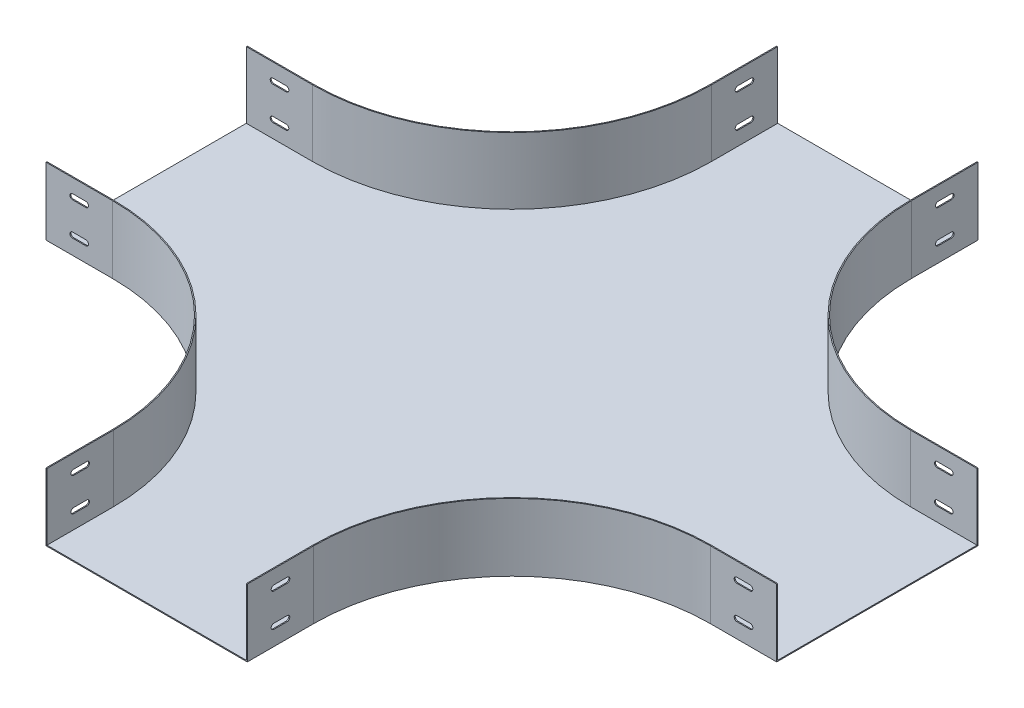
ISO-10303-21;
HEADER;
FILE_DESCRIPTION(('STEP AP214'),'2;1');
FILE_NAME('part.step','',(''),(''),'','','');
FILE_SCHEMA(('AUTOMOTIVE_DESIGN { 1 0 10303 214 1 1 1 1 }'));
ENDSEC;
DATA;
#1=APPLICATION_CONTEXT('core data for automotive mechanical design processes');
#2=APPLICATION_PROTOCOL_DEFINITION('international standard','automotive_design',2000,#1);
#3=PRODUCT_CONTEXT('',#1,'mechanical');
#4=PRODUCT('Part','Part','',(#3));
#5=PRODUCT_RELATED_PRODUCT_CATEGORY('part','',(#4));
#6=PRODUCT_DEFINITION_FORMATION('','',#4);
#7=PRODUCT_DEFINITION_CONTEXT('part definition',#1,'design');
#8=PRODUCT_DEFINITION('design','',#6,#7);
#9=PRODUCT_DEFINITION_SHAPE('','',#8);
#10=(LENGTH_UNIT() NAMED_UNIT(*) SI_UNIT(.MILLI.,.METRE.));
#11=(NAMED_UNIT(*) PLANE_ANGLE_UNIT() SI_UNIT($,.RADIAN.));
#12=(NAMED_UNIT(*) SI_UNIT($,.STERADIAN.) SOLID_ANGLE_UNIT());
#13=UNCERTAINTY_MEASURE_WITH_UNIT(LENGTH_MEASURE(1.E-05),#10,'distance_accuracy_value','');
#14=(GEOMETRIC_REPRESENTATION_CONTEXT(3) GLOBAL_UNCERTAINTY_ASSIGNED_CONTEXT((#13)) GLOBAL_UNIT_ASSIGNED_CONTEXT((#10,
#11,#12)) REPRESENTATION_CONTEXT('',''));
#15=CARTESIAN_POINT('',(0.,0.,0.));
#16=DIRECTION('',(0.,0.,1.));
#17=DIRECTION('',(1.,0.,0.));
#18=AXIS2_PLACEMENT_3D('',#15,#16,#17);
#19=CARTESIAN_POINT('',(-150.,-1.5,-550.));
#20=DIRECTION('',(0.,0.,-1.));
#21=DIRECTION('',(-1.,0.,0.));
#22=AXIS2_PLACEMENT_3D('',#19,#20,#21);
#23=PLANE('',#22);
#24=DIRECTION('',(-1.,0.,0.));
#25=VECTOR('',#24,1.);
#26=CARTESIAN_POINT('',(-150.,0.,-550.));
#27=LINE('',#26,#25);
#28=CARTESIAN_POINT('',(150.,0.,-550.));
#29=VERTEX_POINT('',#28);
#30=CARTESIAN_POINT('',(-150.,0.,-550.));
#31=VERTEX_POINT('',#30);
#32=EDGE_CURVE('E1197',#29,#31,#27,.T.);
#33=ORIENTED_EDGE('',*,*,#32,.F.);
#34=DIRECTION('',(0.,-1.,0.));
#35=VECTOR('',#34,1.);
#36=CARTESIAN_POINT('',(150.,100.,-550.));
#37=LINE('',#36,#35);
#38=CARTESIAN_POINT('',(150.,100.,-550.));
#39=VERTEX_POINT('',#38);
#40=EDGE_CURVE('E1141',#39,#29,#37,.T.);
#41=ORIENTED_EDGE('',*,*,#40,.F.);
#42=DIRECTION('',(1.,0.,0.));
#43=VECTOR('',#42,1.);
#44=CARTESIAN_POINT('',(150.,100.,-550.));
#45=LINE('',#44,#43);
#46=CARTESIAN_POINT('',(151.5,100.,-550.));
#47=VERTEX_POINT('',#46);
#48=EDGE_CURVE('E1107',#39,#47,#45,.T.);
#49=ORIENTED_EDGE('',*,*,#48,.T.);
#50=DIRECTION('',(0.,-1.,0.));
#51=VECTOR('',#50,1.);
#52=CARTESIAN_POINT('',(151.5,100.,-550.));
#53=LINE('',#52,#51);
#54=CARTESIAN_POINT('',(151.5,-1.49999999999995,-550.));
#55=VERTEX_POINT('',#54);
#56=EDGE_CURVE('E1143',#47,#55,#53,.T.);
#57=ORIENTED_EDGE('',*,*,#56,.T.);
#58=DIRECTION('',(-1.,0.,0.));
#59=VECTOR('',#58,1.);
#60=CARTESIAN_POINT('',(-150.,-1.5,-550.));
#61=LINE('',#60,#59);
#62=CARTESIAN_POINT('',(-151.5,-1.49999999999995,-550.));
#63=VERTEX_POINT('',#62);
#64=EDGE_CURVE('E1201',#55,#63,#61,.T.);
#65=ORIENTED_EDGE('',*,*,#64,.T.);
#66=DIRECTION('',(0.,-1.,0.));
#67=VECTOR('',#66,1.);
#68=CARTESIAN_POINT('',(-151.5,100.,-550.));
#69=LINE('',#68,#67);
#70=CARTESIAN_POINT('',(-151.5,100.,-550.));
#71=VERTEX_POINT('',#70);
#72=EDGE_CURVE('E1080',#71,#63,#69,.T.);
#73=ORIENTED_EDGE('',*,*,#72,.F.);
#74=DIRECTION('',(1.,0.,0.));
#75=VECTOR('',#74,1.);
#76=CARTESIAN_POINT('',(-151.5,100.,-550.));
#77=LINE('',#76,#75);
#78=CARTESIAN_POINT('',(-150.,100.,-550.));
#79=VERTEX_POINT('',#78);
#80=EDGE_CURVE('E1069',#71,#79,#77,.T.);
#81=ORIENTED_EDGE('',*,*,#80,.T.);
#82=DIRECTION('',(0.,-1.,0.));
#83=VECTOR('',#82,1.);
#84=CARTESIAN_POINT('',(-150.,100.,-550.));
#85=LINE('',#84,#83);
#86=EDGE_CURVE('E1083',#79,#31,#85,.T.);
#87=ORIENTED_EDGE('',*,*,#86,.T.);
#88=EDGE_LOOP('',(#33,#41,#49,#57,#65,#73,#81,#87));
#89=FACE_BOUND('',#88,.T.);
#90=ADVANCED_FACE('F32',(#89),#23,.T.);
#91=CARTESIAN_POINT('',(550.,-1.5,-150.));
#92=DIRECTION('',(1.,0.,0.));
#93=DIRECTION('',(0.,0.,-1.));
#94=AXIS2_PLACEMENT_3D('',#91,#92,#93);
#95=PLANE('',#94);
#96=DIRECTION('',(0.,0.,-1.));
#97=VECTOR('',#96,1.);
#98=CARTESIAN_POINT('',(550.,0.,-150.));
#99=LINE('',#98,#97);
#100=CARTESIAN_POINT('',(550.,0.,150.));
#101=VERTEX_POINT('',#100);
#102=CARTESIAN_POINT('',(550.,0.,-150.));
#103=VERTEX_POINT('',#102);
#104=EDGE_CURVE('E1236',#101,#103,#99,.T.);
#105=ORIENTED_EDGE('',*,*,#104,.F.);
#106=DIRECTION('',(0.,1.,0.));
#107=VECTOR('',#106,1.);
#108=CARTESIAN_POINT('',(550.,-567.185424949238,150.));
#109=LINE('',#108,#107);
#110=CARTESIAN_POINT('',(550.,100.,150.));
#111=VERTEX_POINT('',#110);
#112=EDGE_CURVE('E1191',#101,#111,#109,.T.);
#113=ORIENTED_EDGE('',*,*,#112,.T.);
#114=DIRECTION('',(0.,0.,1.));
#115=VECTOR('',#114,1.);
#116=CARTESIAN_POINT('',(550.,100.,150.));
#117=LINE('',#116,#115);
#118=CARTESIAN_POINT('',(550.,100.,151.5));
#119=VERTEX_POINT('',#118);
#120=EDGE_CURVE('E1149',#111,#119,#117,.T.);
#121=ORIENTED_EDGE('',*,*,#120,.T.);
#122=DIRECTION('',(0.,1.,0.));
#123=VECTOR('',#122,1.);
#124=CARTESIAN_POINT('',(550.,-567.185424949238,151.5));
#125=LINE('',#124,#123);
#126=CARTESIAN_POINT('',(550.,-1.49999999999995,151.5));
#127=VERTEX_POINT('',#126);
#128=EDGE_CURVE('E1170',#127,#119,#125,.T.);
#129=ORIENTED_EDGE('',*,*,#128,.F.);
#130=DIRECTION('',(0.,0.,-1.));
#131=VECTOR('',#130,1.);
#132=CARTESIAN_POINT('',(550.,-1.5,-150.));
#133=LINE('',#132,#131);
#134=CARTESIAN_POINT('',(550.,-1.49999999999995,-151.5));
#135=VERTEX_POINT('',#134);
#136=EDGE_CURVE('E1199',#127,#135,#133,.T.);
#137=ORIENTED_EDGE('',*,*,#136,.T.);
#138=DIRECTION('',(0.,-1.,0.));
#139=VECTOR('',#138,1.);
#140=CARTESIAN_POINT('',(550.,100.,-151.5));
#141=LINE('',#140,#139);
#142=CARTESIAN_POINT('',(550.,100.,-151.5));
#143=VERTEX_POINT('',#142);
#144=EDGE_CURVE('E1130',#143,#135,#141,.T.);
#145=ORIENTED_EDGE('',*,*,#144,.F.);
#146=DIRECTION('',(0.,0.,1.));
#147=VECTOR('',#146,1.);
#148=CARTESIAN_POINT('',(550.,100.,-151.5));
#149=LINE('',#148,#147);
#150=CARTESIAN_POINT('',(550.,100.,-150.));
#151=VERTEX_POINT('',#150);
#152=EDGE_CURVE('E1119',#143,#151,#149,.T.);
#153=ORIENTED_EDGE('',*,*,#152,.T.);
#154=DIRECTION('',(0.,-1.,0.));
#155=VECTOR('',#154,1.);
#156=CARTESIAN_POINT('',(550.,100.,-150.));
#157=LINE('',#156,#155);
#158=EDGE_CURVE('E1133',#151,#103,#157,.T.);
#159=ORIENTED_EDGE('',*,*,#158,.T.);
#160=EDGE_LOOP('',(#105,#113,#121,#129,#137,#145,#153,#159));
#161=FACE_BOUND('',#160,.T.);
#162=ADVANCED_FACE('F1392',(#161),#95,.T.);
#163=CARTESIAN_POINT('',(-150.,-1.5,550.));
#164=DIRECTION('',(0.,0.,1.));
#165=DIRECTION('',(1.,0.,0.));
#166=AXIS2_PLACEMENT_3D('',#163,#164,#165);
#167=PLANE('',#166);
#168=DIRECTION('',(1.,0.,0.));
#169=VECTOR('',#168,1.);
#170=CARTESIAN_POINT('',(-150.,0.,550.));
#171=LINE('',#170,#169);
#172=CARTESIAN_POINT('',(-150.,0.,550.));
#173=VERTEX_POINT('',#172);
#174=CARTESIAN_POINT('',(150.,0.,550.));
#175=VERTEX_POINT('',#174);
#176=EDGE_CURVE('E1224',#173,#175,#171,.T.);
#177=ORIENTED_EDGE('',*,*,#176,.F.);
#178=DIRECTION('',(0.,-1.,0.));
#179=VECTOR('',#178,1.);
#180=CARTESIAN_POINT('',(-150.,100.,550.));
#181=LINE('',#180,#179);
#182=CARTESIAN_POINT('',(-150.,100.,550.));
#183=VERTEX_POINT('',#182);
#184=EDGE_CURVE('E1041',#183,#173,#181,.T.);
#185=ORIENTED_EDGE('',*,*,#184,.F.);
#186=DIRECTION('',(-1.,0.,0.));
#187=VECTOR('',#186,1.);
#188=CARTESIAN_POINT('',(-150.,100.,550.));
#189=LINE('',#188,#187);
#190=CARTESIAN_POINT('',(-151.5,100.,550.));
#191=VERTEX_POINT('',#190);
#192=EDGE_CURVE('E1007',#183,#191,#189,.T.);
#193=ORIENTED_EDGE('',*,*,#192,.T.);
#194=DIRECTION('',(0.,-1.,0.));
#195=VECTOR('',#194,1.);
#196=CARTESIAN_POINT('',(-151.5,100.,550.));
#197=LINE('',#196,#195);
#198=CARTESIAN_POINT('',(-151.5,-1.49999999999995,550.));
#199=VERTEX_POINT('',#198);
#200=EDGE_CURVE('E1043',#191,#199,#197,.T.);
#201=ORIENTED_EDGE('',*,*,#200,.T.);
#202=DIRECTION('',(1.,0.,0.));
#203=VECTOR('',#202,1.);
#204=CARTESIAN_POINT('',(-150.,-1.5,550.));
#205=LINE('',#204,#203);
#206=CARTESIAN_POINT('',(151.5,-1.49999999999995,550.));
#207=VERTEX_POINT('',#206);
#208=EDGE_CURVE('E1196',#199,#207,#205,.T.);
#209=ORIENTED_EDGE('',*,*,#208,.T.);
#210=DIRECTION('',(0.,1.,0.));
#211=VECTOR('',#210,1.);
#212=CARTESIAN_POINT('',(151.5,-567.185424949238,550.));
#213=LINE('',#212,#211);
#214=CARTESIAN_POINT('',(151.5,100.,550.));
#215=VERTEX_POINT('',#214);
#216=EDGE_CURVE('E1183',#207,#215,#213,.T.);
#217=ORIENTED_EDGE('',*,*,#216,.T.);
#218=DIRECTION('',(-1.,0.,0.));
#219=VECTOR('',#218,1.);
#220=CARTESIAN_POINT('',(151.5,100.,550.));
#221=LINE('',#220,#219);
#222=CARTESIAN_POINT('',(150.,100.,550.));
#223=VERTEX_POINT('',#222);
#224=EDGE_CURVE('E1161',#215,#223,#221,.T.);
#225=ORIENTED_EDGE('',*,*,#224,.T.);
#226=DIRECTION('',(0.,1.,0.));
#227=VECTOR('',#226,1.);
#228=CARTESIAN_POINT('',(150.,-567.185424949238,550.));
#229=LINE('',#228,#227);
#230=EDGE_CURVE('E1185',#175,#223,#229,.T.);
#231=ORIENTED_EDGE('',*,*,#230,.F.);
#232=EDGE_LOOP('',(#177,#185,#193,#201,#209,#217,#225,#231));
#233=FACE_BOUND('',#232,.T.);
#234=ADVANCED_FACE('F1411',(#233),#167,.T.);
#235=CARTESIAN_POINT('',(-550.,-1.5,-150.));
#236=DIRECTION('',(-1.,0.,0.));
#237=DIRECTION('',(0.,0.,1.));
#238=AXIS2_PLACEMENT_3D('',#235,#236,#237);
#239=PLANE('',#238);
#240=DIRECTION('',(0.,0.,1.));
#241=VECTOR('',#240,1.);
#242=CARTESIAN_POINT('',(-550.,0.,-150.));
#243=LINE('',#242,#241);
#244=CARTESIAN_POINT('',(-550.,0.,-150.));
#245=VERTEX_POINT('',#244);
#246=CARTESIAN_POINT('',(-550.,0.,150.));
#247=VERTEX_POINT('',#246);
#248=EDGE_CURVE('E1212',#245,#247,#243,.T.);
#249=ORIENTED_EDGE('',*,*,#248,.F.);
#250=DIRECTION('',(0.,-1.,0.));
#251=VECTOR('',#250,1.);
#252=CARTESIAN_POINT('',(-550.,100.,-150.));
#253=LINE('',#252,#251);
#254=CARTESIAN_POINT('',(-550.,100.,-150.));
#255=VERTEX_POINT('',#254);
#256=EDGE_CURVE('E1091',#255,#245,#253,.T.);
#257=ORIENTED_EDGE('',*,*,#256,.F.);
#258=DIRECTION('',(0.,0.,-1.));
#259=VECTOR('',#258,1.);
#260=CARTESIAN_POINT('',(-550.,100.,-150.));
#261=LINE('',#260,#259);
#262=CARTESIAN_POINT('',(-550.,100.,-151.5));
#263=VERTEX_POINT('',#262);
#264=EDGE_CURVE('E1057',#255,#263,#261,.T.);
#265=ORIENTED_EDGE('',*,*,#264,.T.);
#266=DIRECTION('',(0.,-1.,0.));
#267=VECTOR('',#266,1.);
#268=CARTESIAN_POINT('',(-550.,100.,-151.5));
#269=LINE('',#268,#267);
#270=CARTESIAN_POINT('',(-550.,-1.49999999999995,-151.5));
#271=VERTEX_POINT('',#270);
#272=EDGE_CURVE('E1093',#263,#271,#269,.T.);
#273=ORIENTED_EDGE('',*,*,#272,.T.);
#274=DIRECTION('',(0.,0.,1.));
#275=VECTOR('',#274,1.);
#276=CARTESIAN_POINT('',(-550.,-1.5,-150.));
#277=LINE('',#276,#275);
#278=CARTESIAN_POINT('',(-550.,-1.49999999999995,151.5));
#279=VERTEX_POINT('',#278);
#280=EDGE_CURVE('E1194',#271,#279,#277,.T.);
#281=ORIENTED_EDGE('',*,*,#280,.T.);
#282=DIRECTION('',(0.,-1.,0.));
#283=VECTOR('',#282,1.);
#284=CARTESIAN_POINT('',(-550.,100.,151.5));
#285=LINE('',#284,#283);
#286=CARTESIAN_POINT('',(-550.,100.,151.5));
#287=VERTEX_POINT('',#286);
#288=EDGE_CURVE('E1030',#287,#279,#285,.T.);
#289=ORIENTED_EDGE('',*,*,#288,.F.);
#290=DIRECTION('',(0.,0.,-1.));
#291=VECTOR('',#290,1.);
#292=CARTESIAN_POINT('',(-550.,100.,151.5));
#293=LINE('',#292,#291);
#294=CARTESIAN_POINT('',(-550.,100.,150.));
#295=VERTEX_POINT('',#294);
#296=EDGE_CURVE('E1019',#287,#295,#293,.T.);
#297=ORIENTED_EDGE('',*,*,#296,.T.);
#298=DIRECTION('',(0.,-1.,0.));
#299=VECTOR('',#298,1.);
#300=CARTESIAN_POINT('',(-550.,100.,150.));
#301=LINE('',#300,#299);
#302=EDGE_CURVE('E1033',#295,#247,#301,.T.);
#303=ORIENTED_EDGE('',*,*,#302,.T.);
#304=EDGE_LOOP('',(#249,#257,#265,#273,#281,#289,#297,#303));
#305=FACE_BOUND('',#304,.T.);
#306=ADVANCED_FACE('F34',(#305),#239,.T.);
#307=CARTESIAN_POINT('',(-450.,-1.5,-450.));
#308=DIRECTION('',(0.,1.,0.));
#309=DIRECTION('',(0.,0.,1.));
#310=AXIS2_PLACEMENT_3D('',#307,#308,#309);
#311=PLANE('',#310);
#312=ORIENTED_EDGE('',*,*,#208,.F.);
#313=DIRECTION('',(0.,0.,-1.));
#314=VECTOR('',#313,1.);
#315=CARTESIAN_POINT('',(-151.5,-1.49999999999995,450.));
#316=LINE('',#315,#314);
#317=CARTESIAN_POINT('',(-151.5,-1.49999999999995,450.));
#318=VERTEX_POINT('',#317);
#319=EDGE_CURVE('E1002',#199,#318,#316,.T.);
#320=ORIENTED_EDGE('',*,*,#319,.T.);
#321=CARTESIAN_POINT('',(-450.,-1.49999999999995,450.));
#322=DIRECTION('',(0.,1.,0.));
#323=DIRECTION('',(0.,0.,1.));
#324=AXIS2_PLACEMENT_3D('',#321,#322,#323);
#325=CIRCLE('',#324,298.5);
#326=CARTESIAN_POINT('',(-450.,-1.49999999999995,151.5));
#327=VERTEX_POINT('',#326);
#328=EDGE_CURVE('E999',#318,#327,#325,.T.);
#329=ORIENTED_EDGE('',*,*,#328,.T.);
#330=DIRECTION('',(-1.,0.,0.));
#331=VECTOR('',#330,1.);
#332=CARTESIAN_POINT('',(-550.,-1.49999999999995,151.5));
#333=LINE('',#332,#331);
#334=EDGE_CURVE('E996',#327,#279,#333,.T.);
#335=ORIENTED_EDGE('',*,*,#334,.T.);
#336=ORIENTED_EDGE('',*,*,#280,.F.);
#337=DIRECTION('',(1.,0.,0.));
#338=VECTOR('',#337,1.);
#339=CARTESIAN_POINT('',(-450.,-1.49999999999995,-151.5));
#340=LINE('',#339,#338);
#341=CARTESIAN_POINT('',(-450.,-1.49999999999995,-151.5));
#342=VERTEX_POINT('',#341);
#343=EDGE_CURVE('E1052',#271,#342,#340,.T.);
#344=ORIENTED_EDGE('',*,*,#343,.T.);
#345=CARTESIAN_POINT('',(-450.,-1.49999999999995,-450.));
#346=DIRECTION('',(0.,1.,0.));
#347=DIRECTION('',(0.,0.,1.));
#348=AXIS2_PLACEMENT_3D('',#345,#346,#347);
#349=CIRCLE('',#348,298.5);
#350=CARTESIAN_POINT('',(-151.5,-1.49999999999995,-450.));
#351=VERTEX_POINT('',#350);
#352=EDGE_CURVE('E1049',#342,#351,#349,.T.);
#353=ORIENTED_EDGE('',*,*,#352,.T.);
#354=DIRECTION('',(0.,0.,-1.));
#355=VECTOR('',#354,1.);
#356=CARTESIAN_POINT('',(-151.5,-1.49999999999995,-550.));
#357=LINE('',#356,#355);
#358=EDGE_CURVE('E1046',#351,#63,#357,.T.);
#359=ORIENTED_EDGE('',*,*,#358,.T.);
#360=ORIENTED_EDGE('',*,*,#64,.F.);
#361=DIRECTION('',(0.,0.,1.));
#362=VECTOR('',#361,1.);
#363=CARTESIAN_POINT('',(151.5,-1.49999999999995,-450.));
#364=LINE('',#363,#362);
#365=CARTESIAN_POINT('',(151.5,-1.49999999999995,-450.));
#366=VERTEX_POINT('',#365);
#367=EDGE_CURVE('E1102',#55,#366,#364,.T.);
#368=ORIENTED_EDGE('',*,*,#367,.T.);
#369=CARTESIAN_POINT('',(450.,-1.49999999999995,-450.));
#370=DIRECTION('',(0.,1.,0.));
#371=DIRECTION('',(0.,0.,1.));
#372=AXIS2_PLACEMENT_3D('',#369,#370,#371);
#373=CIRCLE('',#372,298.5);
#374=CARTESIAN_POINT('',(450.,-1.49999999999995,-151.5));
#375=VERTEX_POINT('',#374);
#376=EDGE_CURVE('E1099',#366,#375,#373,.T.);
#377=ORIENTED_EDGE('',*,*,#376,.T.);
#378=DIRECTION('',(1.,0.,0.));
#379=VECTOR('',#378,1.);
#380=CARTESIAN_POINT('',(550.,-1.49999999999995,-151.5));
#381=LINE('',#380,#379);
#382=EDGE_CURVE('E1096',#375,#135,#381,.T.);
#383=ORIENTED_EDGE('',*,*,#382,.T.);
#384=ORIENTED_EDGE('',*,*,#136,.F.);
#385=DIRECTION('',(-1.,0.,0.));
#386=VECTOR('',#385,1.);
#387=CARTESIAN_POINT('',(450.,-1.49999999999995,151.5));
#388=LINE('',#387,#386);
#389=CARTESIAN_POINT('',(450.,-1.49999999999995,151.5));
#390=VERTEX_POINT('',#389);
#391=EDGE_CURVE('E1177',#127,#390,#388,.T.);
#392=ORIENTED_EDGE('',*,*,#391,.T.);
#393=CARTESIAN_POINT('',(450.,-1.49999999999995,450.));
#394=DIRECTION('',(0.,1.,0.));
#395=DIRECTION('',(0.,0.,1.));
#396=AXIS2_PLACEMENT_3D('',#393,#394,#395);
#397=CIRCLE('',#396,298.5);
#398=CARTESIAN_POINT('',(151.5,-1.49999999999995,450.));
#399=VERTEX_POINT('',#398);
#400=EDGE_CURVE('E1174',#390,#399,#397,.T.);
#401=ORIENTED_EDGE('',*,*,#400,.T.);
#402=DIRECTION('',(0.,0.,1.));
#403=VECTOR('',#402,1.);
#404=CARTESIAN_POINT('',(151.5,-1.49999999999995,550.));
#405=LINE('',#404,#403);
#406=EDGE_CURVE('E1171',#399,#207,#405,.T.);
#407=ORIENTED_EDGE('',*,*,#406,.T.);
#408=EDGE_LOOP('',(#312,#320,#329,#335,#336,#344,#353,#359,#360,#368,#377,#383,#384,#392,#401,#407));
#409=FACE_BOUND('',#408,.T.);
#410=ADVANCED_FACE('F1375',(#409),#311,.F.);
#411=CARTESIAN_POINT('',(-450.,0.,-450.));
#412=DIRECTION('',(0.,1.,0.));
#413=DIRECTION('',(0.,0.,1.));
#414=AXIS2_PLACEMENT_3D('',#411,#412,#413);
#415=PLANE('',#414);
#416=DIRECTION('',(0.,0.,1.));
#417=VECTOR('',#416,1.);
#418=CARTESIAN_POINT('',(-150.,0.,-550.));
#419=LINE('',#418,#417);
#420=CARTESIAN_POINT('',(-150.,0.,-450.));
#421=VERTEX_POINT('',#420);
#422=EDGE_CURVE('E1179',#31,#421,#419,.T.);
#423=ORIENTED_EDGE('',*,*,#422,.T.);
#424=CARTESIAN_POINT('',(-450.,0.,-450.));
#425=DIRECTION('',(0.,-1.,0.));
#426=DIRECTION('',(0.,0.,1.));
#427=AXIS2_PLACEMENT_3D('',#424,#425,#426);
#428=CIRCLE('',#427,300.);
#429=CARTESIAN_POINT('',(-450.,0.,-150.));
#430=VERTEX_POINT('',#429);
#431=EDGE_CURVE('E1206',#421,#430,#428,.T.);
#432=ORIENTED_EDGE('',*,*,#431,.T.);
#433=DIRECTION('',(-1.,0.,0.));
#434=VECTOR('',#433,1.);
#435=CARTESIAN_POINT('',(-550.,0.,-150.));
#436=LINE('',#435,#434);
#437=EDGE_CURVE('E1209',#430,#245,#436,.T.);
#438=ORIENTED_EDGE('',*,*,#437,.T.);
#439=ORIENTED_EDGE('',*,*,#248,.T.);
#440=DIRECTION('',(1.,0.,0.));
#441=VECTOR('',#440,1.);
#442=CARTESIAN_POINT('',(-550.,0.,150.));
#443=LINE('',#442,#441);
#444=CARTESIAN_POINT('',(-450.,0.,150.));
#445=VERTEX_POINT('',#444);
#446=EDGE_CURVE('E1215',#247,#445,#443,.T.);
#447=ORIENTED_EDGE('',*,*,#446,.T.);
#448=CARTESIAN_POINT('',(-450.,0.,450.));
#449=DIRECTION('',(0.,-1.,0.));
#450=DIRECTION('',(0.,0.,-1.));
#451=AXIS2_PLACEMENT_3D('',#448,#449,#450);
#452=CIRCLE('',#451,300.);
#453=CARTESIAN_POINT('',(-150.,0.,450.));
#454=VERTEX_POINT('',#453);
#455=EDGE_CURVE('E1218',#445,#454,#452,.T.);
#456=ORIENTED_EDGE('',*,*,#455,.T.);
#457=DIRECTION('',(0.,0.,1.));
#458=VECTOR('',#457,1.);
#459=CARTESIAN_POINT('',(-150.,0.,550.));
#460=LINE('',#459,#458);
#461=EDGE_CURVE('E1221',#454,#173,#460,.T.);
#462=ORIENTED_EDGE('',*,*,#461,.T.);
#463=ORIENTED_EDGE('',*,*,#176,.T.);
#464=DIRECTION('',(0.,0.,-1.));
#465=VECTOR('',#464,1.);
#466=CARTESIAN_POINT('',(150.,0.,550.));
#467=LINE('',#466,#465);
#468=CARTESIAN_POINT('',(150.,0.,450.));
#469=VERTEX_POINT('',#468);
#470=EDGE_CURVE('E1227',#175,#469,#467,.T.);
#471=ORIENTED_EDGE('',*,*,#470,.T.);
#472=CARTESIAN_POINT('',(450.,0.,450.));
#473=DIRECTION('',(0.,-1.,0.));
#474=DIRECTION('',(0.,0.,-1.));
#475=AXIS2_PLACEMENT_3D('',#472,#473,#474);
#476=CIRCLE('',#475,300.);
#477=CARTESIAN_POINT('',(450.,0.,150.));
#478=VERTEX_POINT('',#477);
#479=EDGE_CURVE('E1230',#469,#478,#476,.T.);
#480=ORIENTED_EDGE('',*,*,#479,.T.);
#481=DIRECTION('',(1.,0.,0.));
#482=VECTOR('',#481,1.);
#483=CARTESIAN_POINT('',(550.,0.,150.));
#484=LINE('',#483,#482);
#485=EDGE_CURVE('E1233',#478,#101,#484,.T.);
#486=ORIENTED_EDGE('',*,*,#485,.T.);
#487=ORIENTED_EDGE('',*,*,#104,.T.);
#488=DIRECTION('',(-1.,0.,0.));
#489=VECTOR('',#488,1.);
#490=CARTESIAN_POINT('',(550.,0.,-150.));
#491=LINE('',#490,#489);
#492=CARTESIAN_POINT('',(450.,0.,-150.));
#493=VERTEX_POINT('',#492);
#494=EDGE_CURVE('E1239',#103,#493,#491,.T.);
#495=ORIENTED_EDGE('',*,*,#494,.T.);
#496=CARTESIAN_POINT('',(450.,0.,-450.));
#497=DIRECTION('',(0.,-1.,0.));
#498=DIRECTION('',(0.,0.,1.));
#499=AXIS2_PLACEMENT_3D('',#496,#497,#498);
#500=CIRCLE('',#499,300.);
#501=CARTESIAN_POINT('',(150.,0.,-450.));
#502=VERTEX_POINT('',#501);
#503=EDGE_CURVE('E1242',#493,#502,#500,.T.);
#504=ORIENTED_EDGE('',*,*,#503,.T.);
#505=DIRECTION('',(0.,0.,-1.));
#506=VECTOR('',#505,1.);
#507=CARTESIAN_POINT('',(150.,0.,-550.));
#508=LINE('',#507,#506);
#509=EDGE_CURVE('E1245',#502,#29,#508,.T.);
#510=ORIENTED_EDGE('',*,*,#509,.T.);
#511=ORIENTED_EDGE('',*,*,#32,.T.);
#512=EDGE_LOOP('',(#423,#432,#438,#439,#447,#456,#462,#463,#471,#480,#486,#487,#495,#504,#510,#511));
#513=FACE_BOUND('',#512,.T.);
#514=ADVANCED_FACE('F1404',(#513),#415,.T.);
#515=CARTESIAN_POINT('',(450.,-567.185424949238,150.));
#516=DIRECTION('',(0.,0.,1.));
#517=DIRECTION('',(1.,0.,0.));
#518=AXIS2_PLACEMENT_3D('',#515,#516,#517);
#519=PLANE('',#518);
#520=DIRECTION('',(-1.,0.,0.));
#521=VECTOR('',#520,1.);
#522=CARTESIAN_POINT('',(450.,29.,150.));
#523=LINE('',#522,#521);
#524=CARTESIAN_POINT('',(510.,29.,150.));
#525=VERTEX_POINT('',#524);
#526=CARTESIAN_POINT('',(490.,29.,150.));
#527=VERTEX_POINT('',#526);
#528=EDGE_CURVE('E939',#525,#527,#523,.T.);
#529=ORIENTED_EDGE('',*,*,#528,.T.);
#530=CARTESIAN_POINT('',(490.,25.,150.));
#531=DIRECTION('',(0.,0.,1.));
#532=DIRECTION('',(1.,0.,0.));
#533=AXIS2_PLACEMENT_3D('',#530,#531,#532);
#534=CIRCLE('',#533,4.);
#535=CARTESIAN_POINT('',(490.,21.,150.));
#536=VERTEX_POINT('',#535);
#537=EDGE_CURVE('E948',#527,#536,#534,.T.);
#538=ORIENTED_EDGE('',*,*,#537,.T.);
#539=DIRECTION('',(1.,0.,0.));
#540=VECTOR('',#539,1.);
#541=CARTESIAN_POINT('',(450.,21.,150.));
#542=LINE('',#541,#540);
#543=CARTESIAN_POINT('',(510.,21.,150.));
#544=VERTEX_POINT('',#543);
#545=EDGE_CURVE('E925',#536,#544,#542,.T.);
#546=ORIENTED_EDGE('',*,*,#545,.T.);
#547=CARTESIAN_POINT('',(510.,25.,150.));
#548=DIRECTION('',(0.,0.,1.));
#549=DIRECTION('',(1.,0.,0.));
#550=AXIS2_PLACEMENT_3D('',#547,#548,#549);
#551=CIRCLE('',#550,4.);
#552=EDGE_CURVE('E932',#544,#525,#551,.T.);
#553=ORIENTED_EDGE('',*,*,#552,.T.);
#554=EDGE_LOOP('',(#529,#538,#546,#553));
#555=FACE_BOUND('',#554,.T.);
#556=DIRECTION('',(-1.,0.,0.));
#557=VECTOR('',#556,1.);
#558=CARTESIAN_POINT('',(450.,79.,150.));
#559=LINE('',#558,#557);
#560=CARTESIAN_POINT('',(510.,79.,150.));
#561=VERTEX_POINT('',#560);
#562=CARTESIAN_POINT('',(490.,79.,150.));
#563=VERTEX_POINT('',#562);
#564=EDGE_CURVE('E984',#561,#563,#559,.T.);
#565=ORIENTED_EDGE('',*,*,#564,.T.);
#566=CARTESIAN_POINT('',(490.,75.,150.));
#567=DIRECTION('',(0.,0.,1.));
#568=DIRECTION('',(1.,0.,0.));
#569=AXIS2_PLACEMENT_3D('',#566,#567,#568);
#570=CIRCLE('',#569,4.);
#571=CARTESIAN_POINT('',(490.,71.,150.));
#572=VERTEX_POINT('',#571);
#573=EDGE_CURVE('E993',#563,#572,#570,.T.);
#574=ORIENTED_EDGE('',*,*,#573,.T.);
#575=DIRECTION('',(1.,0.,0.));
#576=VECTOR('',#575,1.);
#577=CARTESIAN_POINT('',(450.,71.,150.));
#578=LINE('',#577,#576);
#579=CARTESIAN_POINT('',(510.,71.,150.));
#580=VERTEX_POINT('',#579);
#581=EDGE_CURVE('E970',#572,#580,#578,.T.);
#582=ORIENTED_EDGE('',*,*,#581,.T.);
#583=CARTESIAN_POINT('',(510.,75.,150.));
#584=DIRECTION('',(0.,0.,1.));
#585=DIRECTION('',(1.,0.,0.));
#586=AXIS2_PLACEMENT_3D('',#583,#584,#585);
#587=CIRCLE('',#586,4.);
#588=EDGE_CURVE('E977',#580,#561,#587,.T.);
#589=ORIENTED_EDGE('',*,*,#588,.T.);
#590=EDGE_LOOP('',(#565,#574,#582,#589));
#591=FACE_BOUND('',#590,.T.);
#592=ORIENTED_EDGE('',*,*,#485,.F.);
#593=DIRECTION('',(0.,1.,0.));
#594=VECTOR('',#593,1.);
#595=CARTESIAN_POINT('',(450.,-567.185424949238,150.));
#596=LINE('',#595,#594);
#597=CARTESIAN_POINT('',(450.,100.,150.));
#598=VERTEX_POINT('',#597);
#599=EDGE_CURVE('E1189',#478,#598,#596,.T.);
#600=ORIENTED_EDGE('',*,*,#599,.T.);
#601=DIRECTION('',(1.,0.,0.));
#602=VECTOR('',#601,1.);
#603=CARTESIAN_POINT('',(450.,100.,150.));
#604=LINE('',#603,#602);
#605=EDGE_CURVE('E1152',#598,#111,#604,.T.);
#606=ORIENTED_EDGE('',*,*,#605,.T.);
#607=ORIENTED_EDGE('',*,*,#112,.F.);
#608=EDGE_LOOP('',(#592,#600,#606,#607));
#609=FACE_BOUND('',#608,.T.);
#610=ADVANCED_FACE('F1398',(#555,#591,#609),#519,.F.);
#611=CARTESIAN_POINT('',(450.,-567.185424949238,450.));
#612=DIRECTION('',(0.,1.,0.));
#613=DIRECTION('',(0.,0.,1.));
#614=AXIS2_PLACEMENT_3D('',#611,#612,#613);
#615=CYLINDRICAL_SURFACE('',#614,300.);
#616=ORIENTED_EDGE('',*,*,#479,.F.);
#617=DIRECTION('',(0.,1.,0.));
#618=VECTOR('',#617,1.);
#619=CARTESIAN_POINT('',(150.,-567.185424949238,450.));
#620=LINE('',#619,#618);
#621=CARTESIAN_POINT('',(150.,100.,450.));
#622=VERTEX_POINT('',#621);
#623=EDGE_CURVE('E1187',#469,#622,#620,.T.);
#624=ORIENTED_EDGE('',*,*,#623,.T.);
#625=CARTESIAN_POINT('',(450.,100.,450.));
#626=DIRECTION('',(0.,-1.,0.));
#627=DIRECTION('',(0.,0.,1.));
#628=AXIS2_PLACEMENT_3D('',#625,#626,#627);
#629=CIRCLE('',#628,300.);
#630=EDGE_CURVE('E1155',#622,#598,#629,.T.);
#631=ORIENTED_EDGE('',*,*,#630,.T.);
#632=ORIENTED_EDGE('',*,*,#599,.F.);
#633=EDGE_LOOP('',(#616,#624,#631,#632));
#634=FACE_BOUND('',#633,.T.);
#635=ADVANCED_FACE('F1402',(#634),#615,.T.);
#636=CARTESIAN_POINT('',(150.,-567.185424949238,550.));
#637=DIRECTION('',(1.,0.,0.));
#638=DIRECTION('',(0.,0.,-1.));
#639=AXIS2_PLACEMENT_3D('',#636,#637,#638);
#640=PLANE('',#639);
#641=DIRECTION('',(0.,0.,1.));
#642=VECTOR('',#641,1.);
#643=CARTESIAN_POINT('',(150.,29.,550.));
#644=LINE('',#643,#642);
#645=CARTESIAN_POINT('',(150.,29.,490.));
#646=VERTEX_POINT('',#645);
#647=CARTESIAN_POINT('',(150.,29.,510.));
#648=VERTEX_POINT('',#647);
#649=EDGE_CURVE('E756',#646,#648,#644,.T.);
#650=ORIENTED_EDGE('',*,*,#649,.T.);
#651=CARTESIAN_POINT('',(150.,25.,510.));
#652=DIRECTION('',(1.,0.,0.));
#653=DIRECTION('',(0.,0.,-1.));
#654=AXIS2_PLACEMENT_3D('',#651,#652,#653);
#655=CIRCLE('',#654,4.);
#656=CARTESIAN_POINT('',(150.,21.,510.));
#657=VERTEX_POINT('',#656);
#658=EDGE_CURVE('E765',#648,#657,#655,.T.);
#659=ORIENTED_EDGE('',*,*,#658,.T.);
#660=DIRECTION('',(0.,0.,-1.));
#661=VECTOR('',#660,1.);
#662=CARTESIAN_POINT('',(150.,21.,550.));
#663=LINE('',#662,#661);
#664=CARTESIAN_POINT('',(150.,21.,490.));
#665=VERTEX_POINT('',#664);
#666=EDGE_CURVE('E740',#657,#665,#663,.T.);
#667=ORIENTED_EDGE('',*,*,#666,.T.);
#668=CARTESIAN_POINT('',(150.,25.,490.));
#669=DIRECTION('',(1.,0.,0.));
#670=DIRECTION('',(0.,0.,-1.));
#671=AXIS2_PLACEMENT_3D('',#668,#669,#670);
#672=CIRCLE('',#671,4.);
#673=EDGE_CURVE('E748',#665,#646,#672,.T.);
#674=ORIENTED_EDGE('',*,*,#673,.T.);
#675=EDGE_LOOP('',(#650,#659,#667,#674));
#676=FACE_BOUND('',#675,.T.);
#677=DIRECTION('',(0.,0.,1.));
#678=VECTOR('',#677,1.);
#679=CARTESIAN_POINT('',(150.,79.,550.));
#680=LINE('',#679,#678);
#681=CARTESIAN_POINT('',(150.,79.,490.));
#682=VERTEX_POINT('',#681);
#683=CARTESIAN_POINT('',(150.,79.,510.));
#684=VERTEX_POINT('',#683);
#685=EDGE_CURVE('E804',#682,#684,#680,.T.);
#686=ORIENTED_EDGE('',*,*,#685,.T.);
#687=CARTESIAN_POINT('',(150.,75.,510.));
#688=DIRECTION('',(1.,0.,0.));
#689=DIRECTION('',(0.,0.,-1.));
#690=AXIS2_PLACEMENT_3D('',#687,#688,#689);
#691=CIRCLE('',#690,4.);
#692=CARTESIAN_POINT('',(150.,71.,510.));
#693=VERTEX_POINT('',#692);
#694=EDGE_CURVE('E813',#684,#693,#691,.T.);
#695=ORIENTED_EDGE('',*,*,#694,.T.);
#696=DIRECTION('',(0.,0.,-1.));
#697=VECTOR('',#696,1.);
#698=CARTESIAN_POINT('',(150.,71.,550.));
#699=LINE('',#698,#697);
#700=CARTESIAN_POINT('',(150.,71.,490.));
#701=VERTEX_POINT('',#700);
#702=EDGE_CURVE('E788',#693,#701,#699,.T.);
#703=ORIENTED_EDGE('',*,*,#702,.T.);
#704=CARTESIAN_POINT('',(150.,75.,490.));
#705=DIRECTION('',(1.,0.,0.));
#706=DIRECTION('',(0.,0.,-1.));
#707=AXIS2_PLACEMENT_3D('',#704,#705,#706);
#708=CIRCLE('',#707,4.);
#709=EDGE_CURVE('E796',#701,#682,#708,.T.);
#710=ORIENTED_EDGE('',*,*,#709,.T.);
#711=EDGE_LOOP('',(#686,#695,#703,#710));
#712=FACE_BOUND('',#711,.T.);
#713=ORIENTED_EDGE('',*,*,#470,.F.);
#714=ORIENTED_EDGE('',*,*,#230,.T.);
#715=DIRECTION('',(0.,0.,-1.));
#716=VECTOR('',#715,1.);
#717=CARTESIAN_POINT('',(150.,100.,550.));
#718=LINE('',#717,#716);
#719=EDGE_CURVE('E1158',#223,#622,#718,.T.);
#720=ORIENTED_EDGE('',*,*,#719,.T.);
#721=ORIENTED_EDGE('',*,*,#623,.F.);
#722=EDGE_LOOP('',(#713,#714,#720,#721));
#723=FACE_BOUND('',#722,.T.);
#724=ADVANCED_FACE('F1408',(#676,#712,#723),#640,.F.);
#725=CARTESIAN_POINT('',(151.5,-567.185424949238,550.));
#726=DIRECTION('',(1.,0.,0.));
#727=DIRECTION('',(0.,0.,-1.));
#728=AXIS2_PLACEMENT_3D('',#725,#726,#727);
#729=PLANE('',#728);
#730=CARTESIAN_POINT('',(151.5,25.,510.));
#731=DIRECTION('',(1.,0.,0.));
#732=DIRECTION('',(0.,0.,-1.));
#733=AXIS2_PLACEMENT_3D('',#730,#731,#732);
#734=CIRCLE('',#733,4.);
#735=CARTESIAN_POINT('',(151.5,29.,510.));
#736=VERTEX_POINT('',#735);
#737=CARTESIAN_POINT('',(151.5,21.,510.));
#738=VERTEX_POINT('',#737);
#739=EDGE_CURVE('E762',#736,#738,#734,.T.);
#740=ORIENTED_EDGE('',*,*,#739,.F.);
#741=DIRECTION('',(0.,0.,1.));
#742=VECTOR('',#741,1.);
#743=CARTESIAN_POINT('',(151.5,29.,550.));
#744=LINE('',#743,#742);
#745=CARTESIAN_POINT('',(151.5,29.,490.));
#746=VERTEX_POINT('',#745);
#747=EDGE_CURVE('E754',#746,#736,#744,.T.);
#748=ORIENTED_EDGE('',*,*,#747,.F.);
#749=CARTESIAN_POINT('',(151.5,25.,490.));
#750=DIRECTION('',(1.,0.,0.));
#751=DIRECTION('',(0.,0.,-1.));
#752=AXIS2_PLACEMENT_3D('',#749,#750,#751);
#753=CIRCLE('',#752,4.);
#754=CARTESIAN_POINT('',(151.5,21.,490.));
#755=VERTEX_POINT('',#754);
#756=EDGE_CURVE('E746',#755,#746,#753,.T.);
#757=ORIENTED_EDGE('',*,*,#756,.F.);
#758=DIRECTION('',(0.,0.,-1.));
#759=VECTOR('',#758,1.);
#760=CARTESIAN_POINT('',(151.5,21.,550.));
#761=LINE('',#760,#759);
#762=EDGE_CURVE('E738',#738,#755,#761,.T.);
#763=ORIENTED_EDGE('',*,*,#762,.F.);
#764=EDGE_LOOP('',(#740,#748,#757,#763));
#765=FACE_BOUND('',#764,.T.);
#766=CARTESIAN_POINT('',(151.5,75.,510.));
#767=DIRECTION('',(1.,0.,0.));
#768=DIRECTION('',(0.,0.,-1.));
#769=AXIS2_PLACEMENT_3D('',#766,#767,#768);
#770=CIRCLE('',#769,4.);
#771=CARTESIAN_POINT('',(151.5,79.,510.));
#772=VERTEX_POINT('',#771);
#773=CARTESIAN_POINT('',(151.5,71.,510.));
#774=VERTEX_POINT('',#773);
#775=EDGE_CURVE('E810',#772,#774,#770,.T.);
#776=ORIENTED_EDGE('',*,*,#775,.F.);
#777=DIRECTION('',(0.,0.,1.));
#778=VECTOR('',#777,1.);
#779=CARTESIAN_POINT('',(151.5,79.,550.));
#780=LINE('',#779,#778);
#781=CARTESIAN_POINT('',(151.5,79.,490.));
#782=VERTEX_POINT('',#781);
#783=EDGE_CURVE('E802',#782,#772,#780,.T.);
#784=ORIENTED_EDGE('',*,*,#783,.F.);
#785=CARTESIAN_POINT('',(151.5,75.,490.));
#786=DIRECTION('',(1.,0.,0.));
#787=DIRECTION('',(0.,0.,-1.));
#788=AXIS2_PLACEMENT_3D('',#785,#786,#787);
#789=CIRCLE('',#788,4.);
#790=CARTESIAN_POINT('',(151.5,71.,490.));
#791=VERTEX_POINT('',#790);
#792=EDGE_CURVE('E794',#791,#782,#789,.T.);
#793=ORIENTED_EDGE('',*,*,#792,.F.);
#794=DIRECTION('',(0.,0.,-1.));
#795=VECTOR('',#794,1.);
#796=CARTESIAN_POINT('',(151.5,71.,550.));
#797=LINE('',#796,#795);
#798=EDGE_CURVE('E786',#774,#791,#797,.T.);
#799=ORIENTED_EDGE('',*,*,#798,.F.);
#800=EDGE_LOOP('',(#776,#784,#793,#799));
#801=FACE_BOUND('',#800,.T.);
#802=DIRECTION('',(0.,1.,0.));
#803=VECTOR('',#802,1.);
#804=CARTESIAN_POINT('',(151.5,-567.185424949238,450.));
#805=LINE('',#804,#803);
#806=CARTESIAN_POINT('',(151.5,100.,450.));
#807=VERTEX_POINT('',#806);
#808=EDGE_CURVE('E1181',#399,#807,#805,.T.);
#809=ORIENTED_EDGE('',*,*,#808,.T.);
#810=DIRECTION('',(0.,0.,-1.));
#811=VECTOR('',#810,1.);
#812=CARTESIAN_POINT('',(151.5,100.,550.));
#813=LINE('',#812,#811);
#814=EDGE_CURVE('E1164',#215,#807,#813,.T.);
#815=ORIENTED_EDGE('',*,*,#814,.F.);
#816=ORIENTED_EDGE('',*,*,#216,.F.);
#817=ORIENTED_EDGE('',*,*,#406,.F.);
#818=EDGE_LOOP('',(#809,#815,#816,#817));
#819=FACE_BOUND('',#818,.T.);
#820=ADVANCED_FACE('F1421',(#765,#801,#819),#729,.T.);
#821=CARTESIAN_POINT('',(450.,-567.185424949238,450.));
#822=DIRECTION('',(0.,1.,0.));
#823=DIRECTION('',(0.,0.,1.));
#824=AXIS2_PLACEMENT_3D('',#821,#822,#823);
#825=CYLINDRICAL_SURFACE('',#824,298.5);
#826=DIRECTION('',(0.,1.,0.));
#827=VECTOR('',#826,1.);
#828=CARTESIAN_POINT('',(450.,-567.185424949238,151.5));
#829=LINE('',#828,#827);
#830=CARTESIAN_POINT('',(450.,100.,151.5));
#831=VERTEX_POINT('',#830);
#832=EDGE_CURVE('E1175',#390,#831,#829,.T.);
#833=ORIENTED_EDGE('',*,*,#832,.T.);
#834=CARTESIAN_POINT('',(450.,100.,450.));
#835=DIRECTION('',(0.,1.,0.));
#836=DIRECTION('',(1.,0.,0.));
#837=AXIS2_PLACEMENT_3D('',#834,#835,#836);
#838=CIRCLE('',#837,298.5);
#839=EDGE_CURVE('E1167',#807,#831,#838,.F.);
#840=ORIENTED_EDGE('',*,*,#839,.F.);
#841=ORIENTED_EDGE('',*,*,#808,.F.);
#842=ORIENTED_EDGE('',*,*,#400,.F.);
#843=EDGE_LOOP('',(#833,#840,#841,#842));
#844=FACE_BOUND('',#843,.T.);
#845=ADVANCED_FACE('F1419',(#844),#825,.F.);
#846=CARTESIAN_POINT('',(450.,-567.185424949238,151.5));
#847=DIRECTION('',(0.,0.,1.));
#848=DIRECTION('',(1.,0.,0.));
#849=AXIS2_PLACEMENT_3D('',#846,#847,#848);
#850=PLANE('',#849);
#851=CARTESIAN_POINT('',(490.,25.,151.5));
#852=DIRECTION('',(0.,0.,1.));
#853=DIRECTION('',(1.,0.,0.));
#854=AXIS2_PLACEMENT_3D('',#851,#852,#853);
#855=CIRCLE('',#854,4.);
#856=CARTESIAN_POINT('',(490.,29.,151.5));
#857=VERTEX_POINT('',#856);
#858=CARTESIAN_POINT('',(490.,21.,151.5));
#859=VERTEX_POINT('',#858);
#860=EDGE_CURVE('E945',#857,#859,#855,.T.);
#861=ORIENTED_EDGE('',*,*,#860,.F.);
#862=DIRECTION('',(-1.,0.,0.));
#863=VECTOR('',#862,1.);
#864=CARTESIAN_POINT('',(450.,29.,151.5));
#865=LINE('',#864,#863);
#866=CARTESIAN_POINT('',(510.,29.,151.5));
#867=VERTEX_POINT('',#866);
#868=EDGE_CURVE('E937',#867,#857,#865,.T.);
#869=ORIENTED_EDGE('',*,*,#868,.F.);
#870=CARTESIAN_POINT('',(510.,25.,151.5));
#871=DIRECTION('',(0.,0.,1.));
#872=DIRECTION('',(1.,0.,0.));
#873=AXIS2_PLACEMENT_3D('',#870,#871,#872);
#874=CIRCLE('',#873,4.);
#875=CARTESIAN_POINT('',(510.,21.,151.5));
#876=VERTEX_POINT('',#875);
#877=EDGE_CURVE('E930',#876,#867,#874,.T.);
#878=ORIENTED_EDGE('',*,*,#877,.F.);
#879=DIRECTION('',(1.,0.,0.));
#880=VECTOR('',#879,1.);
#881=CARTESIAN_POINT('',(450.,21.,151.5));
#882=LINE('',#881,#880);
#883=EDGE_CURVE('E923',#859,#876,#882,.T.);
#884=ORIENTED_EDGE('',*,*,#883,.F.);
#885=EDGE_LOOP('',(#861,#869,#878,#884));
#886=FACE_BOUND('',#885,.T.);
#887=CARTESIAN_POINT('',(490.,75.,151.5));
#888=DIRECTION('',(0.,0.,1.));
#889=DIRECTION('',(1.,0.,0.));
#890=AXIS2_PLACEMENT_3D('',#887,#888,#889);
#891=CIRCLE('',#890,4.);
#892=CARTESIAN_POINT('',(490.,79.,151.5));
#893=VERTEX_POINT('',#892);
#894=CARTESIAN_POINT('',(490.,71.,151.5));
#895=VERTEX_POINT('',#894);
#896=EDGE_CURVE('E990',#893,#895,#891,.T.);
#897=ORIENTED_EDGE('',*,*,#896,.F.);
#898=DIRECTION('',(-1.,0.,0.));
#899=VECTOR('',#898,1.);
#900=CARTESIAN_POINT('',(450.,79.,151.5));
#901=LINE('',#900,#899);
#902=CARTESIAN_POINT('',(510.,79.,151.5));
#903=VERTEX_POINT('',#902);
#904=EDGE_CURVE('E982',#903,#893,#901,.T.);
#905=ORIENTED_EDGE('',*,*,#904,.F.);
#906=CARTESIAN_POINT('',(510.,75.,151.5));
#907=DIRECTION('',(0.,0.,1.));
#908=DIRECTION('',(1.,0.,0.));
#909=AXIS2_PLACEMENT_3D('',#906,#907,#908);
#910=CIRCLE('',#909,4.);
#911=CARTESIAN_POINT('',(510.,71.,151.5));
#912=VERTEX_POINT('',#911);
#913=EDGE_CURVE('E975',#912,#903,#910,.T.);
#914=ORIENTED_EDGE('',*,*,#913,.F.);
#915=DIRECTION('',(1.,0.,0.));
#916=VECTOR('',#915,1.);
#917=CARTESIAN_POINT('',(450.,71.,151.5));
#918=LINE('',#917,#916);
#919=EDGE_CURVE('E968',#895,#912,#918,.T.);
#920=ORIENTED_EDGE('',*,*,#919,.F.);
#921=EDGE_LOOP('',(#897,#905,#914,#920));
#922=FACE_BOUND('',#921,.T.);
#923=ORIENTED_EDGE('',*,*,#128,.T.);
#924=DIRECTION('',(1.,0.,0.));
#925=VECTOR('',#924,1.);
#926=CARTESIAN_POINT('',(450.,100.,151.5));
#927=LINE('',#926,#925);
#928=EDGE_CURVE('E1146',#831,#119,#927,.T.);
#929=ORIENTED_EDGE('',*,*,#928,.F.);
#930=ORIENTED_EDGE('',*,*,#832,.F.);
#931=ORIENTED_EDGE('',*,*,#391,.F.);
#932=EDGE_LOOP('',(#923,#929,#930,#931));
#933=FACE_BOUND('',#932,.T.);
#934=ADVANCED_FACE('F1388',(#886,#922,#933),#850,.T.);
#935=CARTESIAN_POINT('',(450.,100.,450.));
#936=DIRECTION('',(0.,-1.,0.));
#937=DIRECTION('',(-1.,0.,0.));
#938=AXIS2_PLACEMENT_3D('',#935,#936,#937);
#939=PLANE('',#938);
#940=ORIENTED_EDGE('',*,*,#928,.T.);
#941=ORIENTED_EDGE('',*,*,#120,.F.);
#942=ORIENTED_EDGE('',*,*,#605,.F.);
#943=ORIENTED_EDGE('',*,*,#630,.F.);
#944=ORIENTED_EDGE('',*,*,#719,.F.);
#945=ORIENTED_EDGE('',*,*,#224,.F.);
#946=ORIENTED_EDGE('',*,*,#814,.T.);
#947=ORIENTED_EDGE('',*,*,#839,.T.);
#948=EDGE_LOOP('',(#940,#941,#942,#943,#944,#945,#946,#947));
#949=FACE_BOUND('',#948,.T.);
#950=ADVANCED_FACE('F1364',(#949),#939,.F.);
#951=CARTESIAN_POINT('',(151.5,100.,-450.));
#952=DIRECTION('',(-1.,0.,0.));
#953=DIRECTION('',(0.,0.,1.));
#954=AXIS2_PLACEMENT_3D('',#951,#952,#953);
#955=PLANE('',#954);
#956=DIRECTION('',(0.,0.,1.));
#957=VECTOR('',#956,1.);
#958=CARTESIAN_POINT('',(151.5,21.,-450.));
#959=LINE('',#958,#957);
#960=CARTESIAN_POINT('',(151.5,21.,-510.));
#961=VERTEX_POINT('',#960);
#962=CARTESIAN_POINT('',(151.5,21.,-490.));
#963=VERTEX_POINT('',#962);
#964=EDGE_CURVE('E652',#961,#963,#959,.T.);
#965=ORIENTED_EDGE('',*,*,#964,.T.);
#966=CARTESIAN_POINT('',(151.5,25.,-490.));
#967=DIRECTION('',(-1.,0.,0.));
#968=DIRECTION('',(0.,0.,1.));
#969=AXIS2_PLACEMENT_3D('',#966,#967,#968);
#970=CIRCLE('',#969,3.99999999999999);
#971=CARTESIAN_POINT('',(151.5,29.,-490.));
#972=VERTEX_POINT('',#971);
#973=EDGE_CURVE('E672',#963,#972,#970,.T.);
#974=ORIENTED_EDGE('',*,*,#973,.T.);
#975=DIRECTION('',(0.,0.,-1.));
#976=VECTOR('',#975,1.);
#977=CARTESIAN_POINT('',(151.5,29.,-450.));
#978=LINE('',#977,#976);
#979=CARTESIAN_POINT('',(151.5,29.,-510.));
#980=VERTEX_POINT('',#979);
#981=EDGE_CURVE('E665',#972,#980,#978,.T.);
#982=ORIENTED_EDGE('',*,*,#981,.T.);
#983=CARTESIAN_POINT('',(151.5,25.,-510.));
#984=DIRECTION('',(-1.,0.,0.));
#985=DIRECTION('',(0.,0.,1.));
#986=AXIS2_PLACEMENT_3D('',#983,#984,#985);
#987=CIRCLE('',#986,3.99999999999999);
#988=EDGE_CURVE('E654',#980,#961,#987,.T.);
#989=ORIENTED_EDGE('',*,*,#988,.T.);
#990=EDGE_LOOP('',(#965,#974,#982,#989));
#991=FACE_BOUND('',#990,.T.);
#992=DIRECTION('',(0.,0.,1.));
#993=VECTOR('',#992,1.);
#994=CARTESIAN_POINT('',(151.5,71.,-450.));
#995=LINE('',#994,#993);
#996=CARTESIAN_POINT('',(151.5,71.,-510.));
#997=VERTEX_POINT('',#996);
#998=CARTESIAN_POINT('',(151.5,71.,-490.));
#999=VERTEX_POINT('',#998);
#1000=EDGE_CURVE('E694',#997,#999,#995,.T.);
#1001=ORIENTED_EDGE('',*,*,#1000,.T.);
#1002=CARTESIAN_POINT('',(151.5,75.,-490.));
#1003=DIRECTION('',(-1.,0.,0.));
#1004=DIRECTION('',(0.,0.,1.));
#1005=AXIS2_PLACEMENT_3D('',#1002,#1003,#1004);
#1006=CIRCLE('',#1005,4.);
#1007=CARTESIAN_POINT('',(151.5,79.,-490.));
#1008=VERTEX_POINT('',#1007);
#1009=EDGE_CURVE('E717',#999,#1008,#1006,.T.);
#1010=ORIENTED_EDGE('',*,*,#1009,.T.);
#1011=DIRECTION('',(0.,0.,-1.));
#1012=VECTOR('',#1011,1.);
#1013=CARTESIAN_POINT('',(151.5,79.,-450.));
#1014=LINE('',#1013,#1012);
#1015=CARTESIAN_POINT('',(151.5,79.,-510.));
#1016=VERTEX_POINT('',#1015);
#1017=EDGE_CURVE('E709',#1008,#1016,#1014,.T.);
#1018=ORIENTED_EDGE('',*,*,#1017,.T.);
#1019=CARTESIAN_POINT('',(151.5,75.,-510.));
#1020=DIRECTION('',(-1.,0.,0.));
#1021=DIRECTION('',(0.,0.,1.));
#1022=AXIS2_PLACEMENT_3D('',#1019,#1020,#1021);
#1023=CIRCLE('',#1022,4.);
#1024=EDGE_CURVE('E702',#1016,#997,#1023,.T.);
#1025=ORIENTED_EDGE('',*,*,#1024,.T.);
#1026=EDGE_LOOP('',(#1001,#1010,#1018,#1025));
#1027=FACE_BOUND('',#1026,.T.);
#1028=DIRECTION('',(0.,-1.,0.));
#1029=VECTOR('',#1028,1.);
#1030=CARTESIAN_POINT('',(151.5,100.,-450.));
#1031=LINE('',#1030,#1029);
#1032=CARTESIAN_POINT('',(151.5,100.,-450.));
#1033=VERTEX_POINT('',#1032);
#1034=EDGE_CURVE('E1126',#1033,#366,#1031,.T.);
#1035=ORIENTED_EDGE('',*,*,#1034,.T.);
#1036=ORIENTED_EDGE('',*,*,#367,.F.);
#1037=ORIENTED_EDGE('',*,*,#56,.F.);
#1038=DIRECTION('',(0.,0.,-1.));
#1039=VECTOR('',#1038,1.);
#1040=CARTESIAN_POINT('',(151.5,100.,-450.));
#1041=LINE('',#1040,#1039);
#1042=EDGE_CURVE('E1105',#1033,#47,#1041,.T.);
#1043=ORIENTED_EDGE('',*,*,#1042,.F.);
#1044=EDGE_LOOP('',(#1035,#1036,#1037,#1043));
#1045=FACE_BOUND('',#1044,.T.);
#1046=ADVANCED_FACE('F1361',(#991,#1027,#1045),#955,.F.);
#1047=CARTESIAN_POINT('',(150.,100.,-450.));
#1048=DIRECTION('',(-1.,0.,0.));
#1049=DIRECTION('',(0.,0.,1.));
#1050=AXIS2_PLACEMENT_3D('',#1047,#1048,#1049);
#1051=PLANE('',#1050);
#1052=CARTESIAN_POINT('',(150.,25.,-490.));
#1053=DIRECTION('',(-1.,0.,0.));
#1054=DIRECTION('',(0.,0.,1.));
#1055=AXIS2_PLACEMENT_3D('',#1052,#1053,#1054);
#1056=CIRCLE('',#1055,3.99999999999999);
#1057=CARTESIAN_POINT('',(150.,21.,-490.));
#1058=VERTEX_POINT('',#1057);
#1059=CARTESIAN_POINT('',(150.,29.,-490.));
#1060=VERTEX_POINT('',#1059);
#1061=EDGE_CURVE('E670',#1058,#1060,#1056,.T.);
#1062=ORIENTED_EDGE('',*,*,#1061,.F.);
#1063=DIRECTION('',(0.,0.,1.));
#1064=VECTOR('',#1063,1.);
#1065=CARTESIAN_POINT('',(150.,21.,-450.));
#1066=LINE('',#1065,#1064);
#1067=CARTESIAN_POINT('',(150.,21.,-510.));
#1068=VERTEX_POINT('',#1067);
#1069=EDGE_CURVE('E634',#1068,#1058,#1066,.T.);
#1070=ORIENTED_EDGE('',*,*,#1069,.F.);
#1071=CARTESIAN_POINT('',(150.,25.,-510.));
#1072=DIRECTION('',(-1.,0.,0.));
#1073=DIRECTION('',(0.,0.,1.));
#1074=AXIS2_PLACEMENT_3D('',#1071,#1072,#1073);
#1075=CIRCLE('',#1074,3.99999999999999);
#1076=CARTESIAN_POINT('',(150.,29.,-510.));
#1077=VERTEX_POINT('',#1076);
#1078=EDGE_CURVE('E651',#1077,#1068,#1075,.T.);
#1079=ORIENTED_EDGE('',*,*,#1078,.F.);
#1080=DIRECTION('',(0.,0.,-1.));
#1081=VECTOR('',#1080,1.);
#1082=CARTESIAN_POINT('',(150.,29.,-450.));
#1083=LINE('',#1082,#1081);
#1084=EDGE_CURVE('E663',#1060,#1077,#1083,.T.);
#1085=ORIENTED_EDGE('',*,*,#1084,.F.);
#1086=EDGE_LOOP('',(#1062,#1070,#1079,#1085));
#1087=FACE_BOUND('',#1086,.T.);
#1088=CARTESIAN_POINT('',(150.,75.,-490.));
#1089=DIRECTION('',(-1.,0.,0.));
#1090=DIRECTION('',(0.,0.,1.));
#1091=AXIS2_PLACEMENT_3D('',#1088,#1089,#1090);
#1092=CIRCLE('',#1091,4.);
#1093=CARTESIAN_POINT('',(150.,71.,-490.));
#1094=VERTEX_POINT('',#1093);
#1095=CARTESIAN_POINT('',(150.,79.,-490.));
#1096=VERTEX_POINT('',#1095);
#1097=EDGE_CURVE('E715',#1094,#1096,#1092,.T.);
#1098=ORIENTED_EDGE('',*,*,#1097,.F.);
#1099=DIRECTION('',(0.,0.,1.));
#1100=VECTOR('',#1099,1.);
#1101=CARTESIAN_POINT('',(150.,71.,-450.));
#1102=LINE('',#1101,#1100);
#1103=CARTESIAN_POINT('',(150.,71.,-510.));
#1104=VERTEX_POINT('',#1103);
#1105=EDGE_CURVE('E692',#1104,#1094,#1102,.T.);
#1106=ORIENTED_EDGE('',*,*,#1105,.F.);
#1107=CARTESIAN_POINT('',(150.,75.,-510.));
#1108=DIRECTION('',(-1.,0.,0.));
#1109=DIRECTION('',(0.,0.,1.));
#1110=AXIS2_PLACEMENT_3D('',#1107,#1108,#1109);
#1111=CIRCLE('',#1110,4.);
#1112=CARTESIAN_POINT('',(150.,79.,-510.));
#1113=VERTEX_POINT('',#1112);
#1114=EDGE_CURVE('E699',#1113,#1104,#1111,.T.);
#1115=ORIENTED_EDGE('',*,*,#1114,.F.);
#1116=DIRECTION('',(0.,0.,-1.));
#1117=VECTOR('',#1116,1.);
#1118=CARTESIAN_POINT('',(150.,79.,-450.));
#1119=LINE('',#1118,#1117);
#1120=EDGE_CURVE('E707',#1096,#1113,#1119,.T.);
#1121=ORIENTED_EDGE('',*,*,#1120,.F.);
#1122=EDGE_LOOP('',(#1098,#1106,#1115,#1121));
#1123=FACE_BOUND('',#1122,.T.);
#1124=ORIENTED_EDGE('',*,*,#40,.T.);
#1125=ORIENTED_EDGE('',*,*,#509,.F.);
#1126=DIRECTION('',(0.,-1.,0.));
#1127=VECTOR('',#1126,1.);
#1128=CARTESIAN_POINT('',(150.,100.,-450.));
#1129=LINE('',#1128,#1127);
#1130=CARTESIAN_POINT('',(150.,100.,-450.));
#1131=VERTEX_POINT('',#1130);
#1132=EDGE_CURVE('E1138',#1131,#502,#1129,.T.);
#1133=ORIENTED_EDGE('',*,*,#1132,.F.);
#1134=DIRECTION('',(0.,0.,-1.));
#1135=VECTOR('',#1134,1.);
#1136=CARTESIAN_POINT('',(150.,100.,-450.));
#1137=LINE('',#1136,#1135);
#1138=EDGE_CURVE('E1110',#1131,#39,#1137,.T.);
#1139=ORIENTED_EDGE('',*,*,#1138,.T.);
#1140=EDGE_LOOP('',(#1124,#1125,#1133,#1139));
#1141=FACE_BOUND('',#1140,.T.);
#1142=ADVANCED_FACE('F1353',(#1087,#1123,#1141),#1051,.T.);
#1143=CARTESIAN_POINT('',(450.,100.,-450.));
#1144=DIRECTION('',(0.,-1.,0.));
#1145=DIRECTION('',(0.,0.,-1.));
#1146=AXIS2_PLACEMENT_3D('',#1143,#1144,#1145);
#1147=CYLINDRICAL_SURFACE('',#1146,300.);
#1148=ORIENTED_EDGE('',*,*,#1132,.T.);
#1149=ORIENTED_EDGE('',*,*,#503,.F.);
#1150=DIRECTION('',(0.,-1.,0.));
#1151=VECTOR('',#1150,1.);
#1152=CARTESIAN_POINT('',(450.,100.,-150.));
#1153=LINE('',#1152,#1151);
#1154=CARTESIAN_POINT('',(450.,100.,-150.));
#1155=VERTEX_POINT('',#1154);
#1156=EDGE_CURVE('E1136',#1155,#493,#1153,.T.);
#1157=ORIENTED_EDGE('',*,*,#1156,.F.);
#1158=CARTESIAN_POINT('',(450.,100.,-450.));
#1159=DIRECTION('',(0.,-1.,0.));
#1160=DIRECTION('',(0.,0.,1.));
#1161=AXIS2_PLACEMENT_3D('',#1158,#1159,#1160);
#1162=CIRCLE('',#1161,300.);
#1163=EDGE_CURVE('E1113',#1155,#1131,#1162,.T.);
#1164=ORIENTED_EDGE('',*,*,#1163,.T.);
#1165=EDGE_LOOP('',(#1148,#1149,#1157,#1164));
#1166=FACE_BOUND('',#1165,.T.);
#1167=ADVANCED_FACE('F1470',(#1166),#1147,.T.);
#1168=CARTESIAN_POINT('',(550.,100.,-150.));
#1169=DIRECTION('',(0.,0.,1.));
#1170=DIRECTION('',(1.,0.,0.));
#1171=AXIS2_PLACEMENT_3D('',#1168,#1169,#1170);
#1172=PLANE('',#1171);
#1173=CARTESIAN_POINT('',(490.,25.,-150.));
#1174=DIRECTION('',(0.,0.,1.));
#1175=DIRECTION('',(1.,0.,0.));
#1176=AXIS2_PLACEMENT_3D('',#1173,#1174,#1175);
#1177=CIRCLE('',#1176,4.);
#1178=CARTESIAN_POINT('',(490.,29.,-150.));
#1179=VERTEX_POINT('',#1178);
#1180=CARTESIAN_POINT('',(490.,21.,-150.));
#1181=VERTEX_POINT('',#1180);
#1182=EDGE_CURVE('E942',#1179,#1181,#1177,.T.);
#1183=ORIENTED_EDGE('',*,*,#1182,.F.);
#1184=DIRECTION('',(-1.,0.,0.));
#1185=VECTOR('',#1184,1.);
#1186=CARTESIAN_POINT('',(550.,29.,-150.));
#1187=LINE('',#1186,#1185);
#1188=CARTESIAN_POINT('',(510.,29.,-150.));
#1189=VERTEX_POINT('',#1188);
#1190=EDGE_CURVE('E935',#1189,#1179,#1187,.T.);
#1191=ORIENTED_EDGE('',*,*,#1190,.F.);
#1192=CARTESIAN_POINT('',(510.,25.,-150.));
#1193=DIRECTION('',(0.,0.,1.));
#1194=DIRECTION('',(1.,0.,0.));
#1195=AXIS2_PLACEMENT_3D('',#1192,#1193,#1194);
#1196=CIRCLE('',#1195,4.);
#1197=CARTESIAN_POINT('',(510.,21.,-150.));
#1198=VERTEX_POINT('',#1197);
#1199=EDGE_CURVE('E928',#1198,#1189,#1196,.T.);
#1200=ORIENTED_EDGE('',*,*,#1199,.F.);
#1201=DIRECTION('',(1.,0.,0.));
#1202=VECTOR('',#1201,1.);
#1203=CARTESIAN_POINT('',(550.,21.,-150.));
#1204=LINE('',#1203,#1202);
#1205=EDGE_CURVE('E921',#1181,#1198,#1204,.T.);
#1206=ORIENTED_EDGE('',*,*,#1205,.F.);
#1207=EDGE_LOOP('',(#1183,#1191,#1200,#1206));
#1208=FACE_BOUND('',#1207,.T.);
#1209=CARTESIAN_POINT('',(490.,75.,-150.));
#1210=DIRECTION('',(0.,0.,1.));
#1211=DIRECTION('',(1.,0.,0.));
#1212=AXIS2_PLACEMENT_3D('',#1209,#1210,#1211);
#1213=CIRCLE('',#1212,4.);
#1214=CARTESIAN_POINT('',(490.,79.,-150.));
#1215=VERTEX_POINT('',#1214);
#1216=CARTESIAN_POINT('',(490.,71.,-150.));
#1217=VERTEX_POINT('',#1216);
#1218=EDGE_CURVE('E987',#1215,#1217,#1213,.T.);
#1219=ORIENTED_EDGE('',*,*,#1218,.F.);
#1220=DIRECTION('',(-1.,0.,0.));
#1221=VECTOR('',#1220,1.);
#1222=CARTESIAN_POINT('',(550.,79.,-150.));
#1223=LINE('',#1222,#1221);
#1224=CARTESIAN_POINT('',(510.,79.,-150.));
#1225=VERTEX_POINT('',#1224);
#1226=EDGE_CURVE('E980',#1225,#1215,#1223,.T.);
#1227=ORIENTED_EDGE('',*,*,#1226,.F.);
#1228=CARTESIAN_POINT('',(510.,75.,-150.));
#1229=DIRECTION('',(0.,0.,1.));
#1230=DIRECTION('',(1.,0.,0.));
#1231=AXIS2_PLACEMENT_3D('',#1228,#1229,#1230);
#1232=CIRCLE('',#1231,4.);
#1233=CARTESIAN_POINT('',(510.,71.,-150.));
#1234=VERTEX_POINT('',#1233);
#1235=EDGE_CURVE('E973',#1234,#1225,#1232,.T.);
#1236=ORIENTED_EDGE('',*,*,#1235,.F.);
#1237=DIRECTION('',(1.,0.,0.));
#1238=VECTOR('',#1237,1.);
#1239=CARTESIAN_POINT('',(550.,71.,-150.));
#1240=LINE('',#1239,#1238);
#1241=EDGE_CURVE('E966',#1217,#1234,#1240,.T.);
#1242=ORIENTED_EDGE('',*,*,#1241,.F.);
#1243=EDGE_LOOP('',(#1219,#1227,#1236,#1242));
#1244=FACE_BOUND('',#1243,.T.);
#1245=ORIENTED_EDGE('',*,*,#1156,.T.);
#1246=ORIENTED_EDGE('',*,*,#494,.F.);
#1247=ORIENTED_EDGE('',*,*,#158,.F.);
#1248=DIRECTION('',(-1.,0.,0.));
#1249=VECTOR('',#1248,1.);
#1250=CARTESIAN_POINT('',(550.,100.,-150.));
#1251=LINE('',#1250,#1249);
#1252=EDGE_CURVE('E1116',#151,#1155,#1251,.T.);
#1253=ORIENTED_EDGE('',*,*,#1252,.T.);
#1254=EDGE_LOOP('',(#1245,#1246,#1247,#1253));
#1255=FACE_BOUND('',#1254,.T.);
#1256=ADVANCED_FACE('F1477',(#1208,#1244,#1255),#1172,.T.);
#1257=CARTESIAN_POINT('',(550.,100.,-151.5));
#1258=DIRECTION('',(0.,0.,1.));
#1259=DIRECTION('',(1.,0.,0.));
#1260=AXIS2_PLACEMENT_3D('',#1257,#1258,#1259);
#1261=PLANE('',#1260);
#1262=DIRECTION('',(-1.,0.,0.));
#1263=VECTOR('',#1262,1.);
#1264=CARTESIAN_POINT('',(550.,29.,-151.5));
#1265=LINE('',#1264,#1263);
#1266=CARTESIAN_POINT('',(510.,29.,-151.5));
#1267=VERTEX_POINT('',#1266);
#1268=CARTESIAN_POINT('',(490.,29.,-151.5));
#1269=VERTEX_POINT('',#1268);
#1270=EDGE_CURVE('E1267',#1267,#1269,#1265,.T.);
#1271=ORIENTED_EDGE('',*,*,#1270,.T.);
#1272=CARTESIAN_POINT('',(490.,25.,-151.5));
#1273=DIRECTION('',(0.,0.,1.));
#1274=DIRECTION('',(1.,0.,0.));
#1275=AXIS2_PLACEMENT_3D('',#1272,#1273,#1274);
#1276=CIRCLE('',#1275,4.);
#1277=CARTESIAN_POINT('',(490.,21.,-151.5));
#1278=VERTEX_POINT('',#1277);
#1279=EDGE_CURVE('E1270',#1269,#1278,#1276,.T.);
#1280=ORIENTED_EDGE('',*,*,#1279,.T.);
#1281=DIRECTION('',(1.,0.,0.));
#1282=VECTOR('',#1281,1.);
#1283=CARTESIAN_POINT('',(550.,21.,-151.5));
#1284=LINE('',#1283,#1282);
#1285=CARTESIAN_POINT('',(510.,21.,-151.5));
#1286=VERTEX_POINT('',#1285);
#1287=EDGE_CURVE('E1261',#1278,#1286,#1284,.T.);
#1288=ORIENTED_EDGE('',*,*,#1287,.T.);
#1289=CARTESIAN_POINT('',(510.,25.,-151.5));
#1290=DIRECTION('',(0.,0.,1.));
#1291=DIRECTION('',(1.,0.,0.));
#1292=AXIS2_PLACEMENT_3D('',#1289,#1290,#1291);
#1293=CIRCLE('',#1292,4.);
#1294=EDGE_CURVE('E1264',#1286,#1267,#1293,.T.);
#1295=ORIENTED_EDGE('',*,*,#1294,.T.);
#1296=EDGE_LOOP('',(#1271,#1280,#1288,#1295));
#1297=FACE_BOUND('',#1296,.T.);
#1298=DIRECTION('',(-1.,0.,0.));
#1299=VECTOR('',#1298,1.);
#1300=CARTESIAN_POINT('',(550.,79.,-151.5));
#1301=LINE('',#1300,#1299);
#1302=CARTESIAN_POINT('',(510.,79.,-151.5));
#1303=VERTEX_POINT('',#1302);
#1304=CARTESIAN_POINT('',(490.,79.,-151.5));
#1305=VERTEX_POINT('',#1304);
#1306=EDGE_CURVE('E1255',#1303,#1305,#1301,.T.);
#1307=ORIENTED_EDGE('',*,*,#1306,.T.);
#1308=CARTESIAN_POINT('',(490.,75.,-151.5));
#1309=DIRECTION('',(0.,0.,1.));
#1310=DIRECTION('',(1.,0.,0.));
#1311=AXIS2_PLACEMENT_3D('',#1308,#1309,#1310);
#1312=CIRCLE('',#1311,4.);
#1313=CARTESIAN_POINT('',(490.,71.,-151.5));
#1314=VERTEX_POINT('',#1313);
#1315=EDGE_CURVE('E1258',#1305,#1314,#1312,.T.);
#1316=ORIENTED_EDGE('',*,*,#1315,.T.);
#1317=DIRECTION('',(1.,0.,0.));
#1318=VECTOR('',#1317,1.);
#1319=CARTESIAN_POINT('',(550.,71.,-151.5));
#1320=LINE('',#1319,#1318);
#1321=CARTESIAN_POINT('',(510.,71.,-151.5));
#1322=VERTEX_POINT('',#1321);
#1323=EDGE_CURVE('E1203',#1314,#1322,#1320,.T.);
#1324=ORIENTED_EDGE('',*,*,#1323,.T.);
#1325=CARTESIAN_POINT('',(510.,75.,-151.5));
#1326=DIRECTION('',(0.,0.,1.));
#1327=DIRECTION('',(1.,0.,0.));
#1328=AXIS2_PLACEMENT_3D('',#1325,#1326,#1327);
#1329=CIRCLE('',#1328,4.);
#1330=EDGE_CURVE('E1252',#1322,#1303,#1329,.T.);
#1331=ORIENTED_EDGE('',*,*,#1330,.T.);
#1332=EDGE_LOOP('',(#1307,#1316,#1324,#1331));
#1333=FACE_BOUND('',#1332,.T.);
#1334=ORIENTED_EDGE('',*,*,#144,.T.);
#1335=ORIENTED_EDGE('',*,*,#382,.F.);
#1336=DIRECTION('',(0.,-1.,0.));
#1337=VECTOR('',#1336,1.);
#1338=CARTESIAN_POINT('',(450.,100.,-151.5));
#1339=LINE('',#1338,#1337);
#1340=CARTESIAN_POINT('',(450.,100.,-151.5));
#1341=VERTEX_POINT('',#1340);
#1342=EDGE_CURVE('E1128',#1341,#375,#1339,.T.);
#1343=ORIENTED_EDGE('',*,*,#1342,.F.);
#1344=DIRECTION('',(-1.,0.,0.));
#1345=VECTOR('',#1344,1.);
#1346=CARTESIAN_POINT('',(550.,100.,-151.5));
#1347=LINE('',#1346,#1345);
#1348=EDGE_CURVE('E1122',#143,#1341,#1347,.T.);
#1349=ORIENTED_EDGE('',*,*,#1348,.F.);
#1350=EDGE_LOOP('',(#1334,#1335,#1343,#1349));
#1351=FACE_BOUND('',#1350,.T.);
#1352=ADVANCED_FACE('F1381',(#1297,#1333,#1351),#1261,.F.);
#1353=CARTESIAN_POINT('',(450.,100.,-450.));
#1354=DIRECTION('',(0.,-1.,0.));
#1355=DIRECTION('',(0.,0.,-1.));
#1356=AXIS2_PLACEMENT_3D('',#1353,#1354,#1355);
#1357=CYLINDRICAL_SURFACE('',#1356,298.5);
#1358=ORIENTED_EDGE('',*,*,#1342,.T.);
#1359=ORIENTED_EDGE('',*,*,#376,.F.);
#1360=ORIENTED_EDGE('',*,*,#1034,.F.);
#1361=CARTESIAN_POINT('',(450.,100.,-450.));
#1362=DIRECTION('',(0.,1.,0.));
#1363=DIRECTION('',(1.,0.,0.));
#1364=AXIS2_PLACEMENT_3D('',#1361,#1362,#1363);
#1365=CIRCLE('',#1364,298.5);
#1366=EDGE_CURVE('E1124',#1341,#1033,#1365,.F.);
#1367=ORIENTED_EDGE('',*,*,#1366,.F.);
#1368=EDGE_LOOP('',(#1358,#1359,#1360,#1367));
#1369=FACE_BOUND('',#1368,.T.);
#1370=ADVANCED_FACE('F1377',(#1369),#1357,.F.);
#1371=CARTESIAN_POINT('',(450.,100.,-450.));
#1372=DIRECTION('',(0.,-1.,0.));
#1373=DIRECTION('',(-1.,0.,0.));
#1374=AXIS2_PLACEMENT_3D('',#1371,#1372,#1373);
#1375=PLANE('',#1374);
#1376=ORIENTED_EDGE('',*,*,#1042,.T.);
#1377=ORIENTED_EDGE('',*,*,#48,.F.);
#1378=ORIENTED_EDGE('',*,*,#1138,.F.);
#1379=ORIENTED_EDGE('',*,*,#1163,.F.);
#1380=ORIENTED_EDGE('',*,*,#1252,.F.);
#1381=ORIENTED_EDGE('',*,*,#152,.F.);
#1382=ORIENTED_EDGE('',*,*,#1348,.T.);
#1383=ORIENTED_EDGE('',*,*,#1366,.T.);
#1384=EDGE_LOOP('',(#1376,#1377,#1378,#1379,#1380,#1381,#1382,#1383));
#1385=FACE_BOUND('',#1384,.T.);
#1386=ADVANCED_FACE('F1474',(#1385),#1375,.F.);
#1387=CARTESIAN_POINT('',(-450.,100.,-151.5));
#1388=DIRECTION('',(0.,0.,1.));
#1389=DIRECTION('',(1.,0.,0.));
#1390=AXIS2_PLACEMENT_3D('',#1387,#1388,#1389);
#1391=PLANE('',#1390);
#1392=DIRECTION('',(-1.,0.,0.));
#1393=VECTOR('',#1392,1.);
#1394=CARTESIAN_POINT('',(-450.,29.,-151.5));
#1395=LINE('',#1394,#1393);
#1396=CARTESIAN_POINT('',(-490.,29.,-151.5));
#1397=VERTEX_POINT('',#1396);
#1398=CARTESIAN_POINT('',(-510.,29.,-151.5));
#1399=VERTEX_POINT('',#1398);
#1400=EDGE_CURVE('E850',#1397,#1399,#1395,.T.);
#1401=ORIENTED_EDGE('',*,*,#1400,.T.);
#1402=CARTESIAN_POINT('',(-510.,25.,-151.5));
#1403=DIRECTION('',(0.,0.,1.));
#1404=DIRECTION('',(1.,0.,0.));
#1405=AXIS2_PLACEMENT_3D('',#1402,#1403,#1404);
#1406=CIRCLE('',#1405,4.);
#1407=CARTESIAN_POINT('',(-510.,21.,-151.5));
#1408=VERTEX_POINT('',#1407);
#1409=EDGE_CURVE('E858',#1399,#1408,#1406,.T.);
#1410=ORIENTED_EDGE('',*,*,#1409,.T.);
#1411=DIRECTION('',(1.,0.,0.));
#1412=VECTOR('',#1411,1.);
#1413=CARTESIAN_POINT('',(-450.,21.,-151.5));
#1414=LINE('',#1413,#1412);
#1415=CARTESIAN_POINT('',(-490.,21.,-151.5));
#1416=VERTEX_POINT('',#1415);
#1417=EDGE_CURVE('E835',#1408,#1416,#1414,.T.);
#1418=ORIENTED_EDGE('',*,*,#1417,.T.);
#1419=CARTESIAN_POINT('',(-490.,25.,-151.5));
#1420=DIRECTION('',(0.,0.,1.));
#1421=DIRECTION('',(1.,0.,0.));
#1422=AXIS2_PLACEMENT_3D('',#1419,#1420,#1421);
#1423=CIRCLE('',#1422,4.);
#1424=EDGE_CURVE('E843',#1416,#1397,#1423,.T.);
#1425=ORIENTED_EDGE('',*,*,#1424,.T.);
#1426=EDGE_LOOP('',(#1401,#1410,#1418,#1425));
#1427=FACE_BOUND('',#1426,.T.);
#1428=DIRECTION('',(-1.,0.,0.));
#1429=VECTOR('',#1428,1.);
#1430=CARTESIAN_POINT('',(-450.,79.,-151.5));
#1431=LINE('',#1430,#1429);
#1432=CARTESIAN_POINT('',(-490.,79.,-151.5));
#1433=VERTEX_POINT('',#1432);
#1434=CARTESIAN_POINT('',(-510.,79.,-151.5));
#1435=VERTEX_POINT('',#1434);
#1436=EDGE_CURVE('E895',#1433,#1435,#1431,.T.);
#1437=ORIENTED_EDGE('',*,*,#1436,.T.);
#1438=CARTESIAN_POINT('',(-510.,75.,-151.5));
#1439=DIRECTION('',(0.,0.,1.));
#1440=DIRECTION('',(1.,0.,0.));
#1441=AXIS2_PLACEMENT_3D('',#1438,#1439,#1440);
#1442=CIRCLE('',#1441,4.);
#1443=CARTESIAN_POINT('',(-510.,71.,-151.5));
#1444=VERTEX_POINT('',#1443);
#1445=EDGE_CURVE('E903',#1435,#1444,#1442,.T.);
#1446=ORIENTED_EDGE('',*,*,#1445,.T.);
#1447=DIRECTION('',(1.,0.,0.));
#1448=VECTOR('',#1447,1.);
#1449=CARTESIAN_POINT('',(-450.,71.,-151.5));
#1450=LINE('',#1449,#1448);
#1451=CARTESIAN_POINT('',(-490.,71.,-151.5));
#1452=VERTEX_POINT('',#1451);
#1453=EDGE_CURVE('E880',#1444,#1452,#1450,.T.);
#1454=ORIENTED_EDGE('',*,*,#1453,.T.);
#1455=CARTESIAN_POINT('',(-490.,75.,-151.5));
#1456=DIRECTION('',(0.,0.,1.));
#1457=DIRECTION('',(1.,0.,0.));
#1458=AXIS2_PLACEMENT_3D('',#1455,#1456,#1457);
#1459=CIRCLE('',#1458,4.);
#1460=EDGE_CURVE('E888',#1452,#1433,#1459,.T.);
#1461=ORIENTED_EDGE('',*,*,#1460,.T.);
#1462=EDGE_LOOP('',(#1437,#1446,#1454,#1461));
#1463=FACE_BOUND('',#1462,.T.);
#1464=DIRECTION('',(0.,-1.,0.));
#1465=VECTOR('',#1464,1.);
#1466=CARTESIAN_POINT('',(-450.,100.,-151.5));
#1467=LINE('',#1466,#1465);
#1468=CARTESIAN_POINT('',(-450.,100.,-151.5));
#1469=VERTEX_POINT('',#1468);
#1470=EDGE_CURVE('E1076',#1469,#342,#1467,.T.);
#1471=ORIENTED_EDGE('',*,*,#1470,.T.);
#1472=ORIENTED_EDGE('',*,*,#343,.F.);
#1473=ORIENTED_EDGE('',*,*,#272,.F.);
#1474=DIRECTION('',(1.,0.,0.));
#1475=VECTOR('',#1474,1.);
#1476=CARTESIAN_POINT('',(-450.,100.,-151.5));
#1477=LINE('',#1476,#1475);
#1478=EDGE_CURVE('E1055',#1469,#263,#1477,.F.);
#1479=ORIENTED_EDGE('',*,*,#1478,.F.);
#1480=EDGE_LOOP('',(#1471,#1472,#1473,#1479));
#1481=FACE_BOUND('',#1480,.T.);
#1482=ADVANCED_FACE('F1491',(#1427,#1463,#1481),#1391,.F.);
#1483=CARTESIAN_POINT('',(-450.,100.,-150.));
#1484=DIRECTION('',(0.,0.,1.));
#1485=DIRECTION('',(1.,0.,0.));
#1486=AXIS2_PLACEMENT_3D('',#1483,#1484,#1485);
#1487=PLANE('',#1486);
#1488=CARTESIAN_POINT('',(-510.,25.,-150.));
#1489=DIRECTION('',(0.,0.,1.));
#1490=DIRECTION('',(1.,0.,0.));
#1491=AXIS2_PLACEMENT_3D('',#1488,#1489,#1490);
#1492=CIRCLE('',#1491,4.);
#1493=CARTESIAN_POINT('',(-510.,29.,-150.));
#1494=VERTEX_POINT('',#1493);
#1495=CARTESIAN_POINT('',(-510.,21.,-150.));
#1496=VERTEX_POINT('',#1495);
#1497=EDGE_CURVE('E855',#1494,#1496,#1492,.T.);
#1498=ORIENTED_EDGE('',*,*,#1497,.F.);
#1499=DIRECTION('',(-1.,0.,0.));
#1500=VECTOR('',#1499,1.);
#1501=CARTESIAN_POINT('',(-450.,29.,-150.));
#1502=LINE('',#1501,#1500);
#1503=CARTESIAN_POINT('',(-490.,29.,-150.));
#1504=VERTEX_POINT('',#1503);
#1505=EDGE_CURVE('E848',#1504,#1494,#1502,.T.);
#1506=ORIENTED_EDGE('',*,*,#1505,.F.);
#1507=CARTESIAN_POINT('',(-490.,25.,-150.));
#1508=DIRECTION('',(0.,0.,1.));
#1509=DIRECTION('',(1.,0.,0.));
#1510=AXIS2_PLACEMENT_3D('',#1507,#1508,#1509);
#1511=CIRCLE('',#1510,4.);
#1512=CARTESIAN_POINT('',(-490.,21.,-150.));
#1513=VERTEX_POINT('',#1512);
#1514=EDGE_CURVE('E841',#1513,#1504,#1511,.T.);
#1515=ORIENTED_EDGE('',*,*,#1514,.F.);
#1516=DIRECTION('',(1.,0.,0.));
#1517=VECTOR('',#1516,1.);
#1518=CARTESIAN_POINT('',(-450.,21.,-150.));
#1519=LINE('',#1518,#1517);
#1520=EDGE_CURVE('E833',#1496,#1513,#1519,.T.);
#1521=ORIENTED_EDGE('',*,*,#1520,.F.);
#1522=EDGE_LOOP('',(#1498,#1506,#1515,#1521));
#1523=FACE_BOUND('',#1522,.T.);
#1524=CARTESIAN_POINT('',(-510.,75.,-150.));
#1525=DIRECTION('',(0.,0.,1.));
#1526=DIRECTION('',(1.,0.,0.));
#1527=AXIS2_PLACEMENT_3D('',#1524,#1525,#1526);
#1528=CIRCLE('',#1527,4.);
#1529=CARTESIAN_POINT('',(-510.,79.,-150.));
#1530=VERTEX_POINT('',#1529);
#1531=CARTESIAN_POINT('',(-510.,71.,-150.));
#1532=VERTEX_POINT('',#1531);
#1533=EDGE_CURVE('E900',#1530,#1532,#1528,.T.);
#1534=ORIENTED_EDGE('',*,*,#1533,.F.);
#1535=DIRECTION('',(-1.,0.,0.));
#1536=VECTOR('',#1535,1.);
#1537=CARTESIAN_POINT('',(-450.,79.,-150.));
#1538=LINE('',#1537,#1536);
#1539=CARTESIAN_POINT('',(-490.,79.,-150.));
#1540=VERTEX_POINT('',#1539);
#1541=EDGE_CURVE('E893',#1540,#1530,#1538,.T.);
#1542=ORIENTED_EDGE('',*,*,#1541,.F.);
#1543=CARTESIAN_POINT('',(-490.,75.,-150.));
#1544=DIRECTION('',(0.,0.,1.));
#1545=DIRECTION('',(1.,0.,0.));
#1546=AXIS2_PLACEMENT_3D('',#1543,#1544,#1545);
#1547=CIRCLE('',#1546,4.);
#1548=CARTESIAN_POINT('',(-490.,71.,-150.));
#1549=VERTEX_POINT('',#1548);
#1550=EDGE_CURVE('E886',#1549,#1540,#1547,.T.);
#1551=ORIENTED_EDGE('',*,*,#1550,.F.);
#1552=DIRECTION('',(1.,0.,0.));
#1553=VECTOR('',#1552,1.);
#1554=CARTESIAN_POINT('',(-450.,71.,-150.));
#1555=LINE('',#1554,#1553);
#1556=EDGE_CURVE('E878',#1532,#1549,#1555,.T.);
#1557=ORIENTED_EDGE('',*,*,#1556,.F.);
#1558=EDGE_LOOP('',(#1534,#1542,#1551,#1557));
#1559=FACE_BOUND('',#1558,.T.);
#1560=ORIENTED_EDGE('',*,*,#256,.T.);
#1561=ORIENTED_EDGE('',*,*,#437,.F.);
#1562=DIRECTION('',(0.,-1.,0.));
#1563=VECTOR('',#1562,1.);
#1564=CARTESIAN_POINT('',(-450.,100.,-150.));
#1565=LINE('',#1564,#1563);
#1566=CARTESIAN_POINT('',(-450.,100.,-150.));
#1567=VERTEX_POINT('',#1566);
#1568=EDGE_CURVE('E1088',#1567,#430,#1565,.T.);
#1569=ORIENTED_EDGE('',*,*,#1568,.F.);
#1570=DIRECTION('',(-1.,0.,0.));
#1571=VECTOR('',#1570,1.);
#1572=CARTESIAN_POINT('',(-450.,100.,-150.));
#1573=LINE('',#1572,#1571);
#1574=EDGE_CURVE('E1060',#1567,#255,#1573,.T.);
#1575=ORIENTED_EDGE('',*,*,#1574,.T.);
#1576=EDGE_LOOP('',(#1560,#1561,#1569,#1575));
#1577=FACE_BOUND('',#1576,.T.);
#1578=ADVANCED_FACE('F1456',(#1523,#1559,#1577),#1487,.T.);
#1579=CARTESIAN_POINT('',(-450.,100.,-450.));
#1580=DIRECTION('',(0.,-1.,0.));
#1581=DIRECTION('',(0.,0.,-1.));
#1582=AXIS2_PLACEMENT_3D('',#1579,#1580,#1581);
#1583=CYLINDRICAL_SURFACE('',#1582,300.);
#1584=ORIENTED_EDGE('',*,*,#1568,.T.);
#1585=ORIENTED_EDGE('',*,*,#431,.F.);
#1586=DIRECTION('',(0.,-1.,0.));
#1587=VECTOR('',#1586,1.);
#1588=CARTESIAN_POINT('',(-150.,100.,-450.));
#1589=LINE('',#1588,#1587);
#1590=CARTESIAN_POINT('',(-150.,100.,-450.));
#1591=VERTEX_POINT('',#1590);
#1592=EDGE_CURVE('E1086',#1591,#421,#1589,.T.);
#1593=ORIENTED_EDGE('',*,*,#1592,.F.);
#1594=CARTESIAN_POINT('',(-450.,100.,-450.));
#1595=DIRECTION('',(0.,-1.,0.));
#1596=DIRECTION('',(0.,0.,1.));
#1597=AXIS2_PLACEMENT_3D('',#1594,#1595,#1596);
#1598=CIRCLE('',#1597,300.);
#1599=EDGE_CURVE('E1063',#1591,#1567,#1598,.T.);
#1600=ORIENTED_EDGE('',*,*,#1599,.T.);
#1601=EDGE_LOOP('',(#1584,#1585,#1593,#1600));
#1602=FACE_BOUND('',#1601,.T.);
#1603=ADVANCED_FACE('F1459',(#1602),#1583,.T.);
#1604=CARTESIAN_POINT('',(-150.,100.,-550.));
#1605=DIRECTION('',(1.,0.,0.));
#1606=DIRECTION('',(0.,0.,-1.));
#1607=AXIS2_PLACEMENT_3D('',#1604,#1605,#1606);
#1608=PLANE('',#1607);
#1609=CARTESIAN_POINT('',(-150.,25.,-490.));
#1610=DIRECTION('',(1.,0.,0.));
#1611=DIRECTION('',(0.,0.,-1.));
#1612=AXIS2_PLACEMENT_3D('',#1609,#1610,#1611);
#1613=CIRCLE('',#1612,3.99999999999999);
#1614=CARTESIAN_POINT('',(-150.,29.,-490.));
#1615=VERTEX_POINT('',#1614);
#1616=CARTESIAN_POINT('',(-150.,21.,-490.));
#1617=VERTEX_POINT('',#1616);
#1618=EDGE_CURVE('E668',#1615,#1617,#1613,.T.);
#1619=ORIENTED_EDGE('',*,*,#1618,.F.);
#1620=DIRECTION('',(0.,0.,1.));
#1621=VECTOR('',#1620,1.);
#1622=CARTESIAN_POINT('',(-150.,29.,-550.));
#1623=LINE('',#1622,#1621);
#1624=CARTESIAN_POINT('',(-150.,29.,-510.));
#1625=VERTEX_POINT('',#1624);
#1626=EDGE_CURVE('E650',#1625,#1615,#1623,.T.);
#1627=ORIENTED_EDGE('',*,*,#1626,.F.);
#1628=CARTESIAN_POINT('',(-150.,25.,-510.));
#1629=DIRECTION('',(1.,0.,0.));
#1630=DIRECTION('',(0.,0.,-1.));
#1631=AXIS2_PLACEMENT_3D('',#1628,#1629,#1630);
#1632=CIRCLE('',#1631,3.99999999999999);
#1633=CARTESIAN_POINT('',(-150.,21.,-510.));
#1634=VERTEX_POINT('',#1633);
#1635=EDGE_CURVE('E640',#1634,#1625,#1632,.T.);
#1636=ORIENTED_EDGE('',*,*,#1635,.F.);
#1637=DIRECTION('',(0.,0.,-1.));
#1638=VECTOR('',#1637,1.);
#1639=CARTESIAN_POINT('',(-150.,21.,-550.));
#1640=LINE('',#1639,#1638);
#1641=EDGE_CURVE('E623',#1617,#1634,#1640,.T.);
#1642=ORIENTED_EDGE('',*,*,#1641,.F.);
#1643=EDGE_LOOP('',(#1619,#1627,#1636,#1642));
#1644=FACE_BOUND('',#1643,.T.);
#1645=CARTESIAN_POINT('',(-150.,75.,-490.));
#1646=DIRECTION('',(1.,0.,0.));
#1647=DIRECTION('',(0.,0.,-1.));
#1648=AXIS2_PLACEMENT_3D('',#1645,#1646,#1647);
#1649=CIRCLE('',#1648,4.);
#1650=CARTESIAN_POINT('',(-150.,79.,-490.));
#1651=VERTEX_POINT('',#1650);
#1652=CARTESIAN_POINT('',(-150.,71.,-490.));
#1653=VERTEX_POINT('',#1652);
#1654=EDGE_CURVE('E712',#1651,#1653,#1649,.T.);
#1655=ORIENTED_EDGE('',*,*,#1654,.F.);
#1656=DIRECTION('',(0.,0.,1.));
#1657=VECTOR('',#1656,1.);
#1658=CARTESIAN_POINT('',(-150.,79.,-550.));
#1659=LINE('',#1658,#1657);
#1660=CARTESIAN_POINT('',(-150.,79.,-510.));
#1661=VERTEX_POINT('',#1660);
#1662=EDGE_CURVE('E705',#1661,#1651,#1659,.T.);
#1663=ORIENTED_EDGE('',*,*,#1662,.F.);
#1664=CARTESIAN_POINT('',(-150.,75.,-510.));
#1665=DIRECTION('',(1.,0.,0.));
#1666=DIRECTION('',(0.,0.,-1.));
#1667=AXIS2_PLACEMENT_3D('',#1664,#1665,#1666);
#1668=CIRCLE('',#1667,4.);
#1669=CARTESIAN_POINT('',(-150.,71.,-510.));
#1670=VERTEX_POINT('',#1669);
#1671=EDGE_CURVE('E697',#1670,#1661,#1668,.T.);
#1672=ORIENTED_EDGE('',*,*,#1671,.F.);
#1673=DIRECTION('',(0.,0.,-1.));
#1674=VECTOR('',#1673,1.);
#1675=CARTESIAN_POINT('',(-150.,71.,-550.));
#1676=LINE('',#1675,#1674);
#1677=EDGE_CURVE('E690',#1653,#1670,#1676,.T.);
#1678=ORIENTED_EDGE('',*,*,#1677,.F.);
#1679=EDGE_LOOP('',(#1655,#1663,#1672,#1678));
#1680=FACE_BOUND('',#1679,.T.);
#1681=ORIENTED_EDGE('',*,*,#1592,.T.);
#1682=ORIENTED_EDGE('',*,*,#422,.F.);
#1683=ORIENTED_EDGE('',*,*,#86,.F.);
#1684=DIRECTION('',(0.,0.,1.));
#1685=VECTOR('',#1684,1.);
#1686=CARTESIAN_POINT('',(-150.,100.,-550.));
#1687=LINE('',#1686,#1685);
#1688=EDGE_CURVE('E1066',#79,#1591,#1687,.T.);
#1689=ORIENTED_EDGE('',*,*,#1688,.T.);
#1690=EDGE_LOOP('',(#1681,#1682,#1683,#1689));
#1691=FACE_BOUND('',#1690,.T.);
#1692=ADVANCED_FACE('F648',(#1644,#1680,#1691),#1608,.T.);
#1693=CARTESIAN_POINT('',(-151.5,100.,-550.));
#1694=DIRECTION('',(1.,0.,0.));
#1695=DIRECTION('',(0.,0.,-1.));
#1696=AXIS2_PLACEMENT_3D('',#1693,#1694,#1695);
#1697=PLANE('',#1696);
#1698=DIRECTION('',(0.,0.,1.));
#1699=VECTOR('',#1698,1.);
#1700=CARTESIAN_POINT('',(-151.5,29.,-550.));
#1701=LINE('',#1700,#1699);
#1702=CARTESIAN_POINT('',(-151.5,29.,-510.));
#1703=VERTEX_POINT('',#1702);
#1704=CARTESIAN_POINT('',(-151.5,29.,-490.));
#1705=VERTEX_POINT('',#1704);
#1706=EDGE_CURVE('E40',#1703,#1705,#1701,.T.);
#1707=ORIENTED_EDGE('',*,*,#1706,.T.);
#1708=CARTESIAN_POINT('',(-151.5,25.,-490.));
#1709=DIRECTION('',(1.,0.,0.));
#1710=DIRECTION('',(0.,0.,-1.));
#1711=AXIS2_PLACEMENT_3D('',#1708,#1709,#1710);
#1712=CIRCLE('',#1711,3.99999999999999);
#1713=CARTESIAN_POINT('',(-151.5,21.,-490.));
#1714=VERTEX_POINT('',#1713);
#1715=EDGE_CURVE('E11',#1705,#1714,#1712,.T.);
#1716=ORIENTED_EDGE('',*,*,#1715,.T.);
#1717=DIRECTION('',(0.,0.,-1.));
#1718=VECTOR('',#1717,1.);
#1719=CARTESIAN_POINT('',(-151.5,21.,-550.));
#1720=LINE('',#1719,#1718);
#1721=CARTESIAN_POINT('',(-151.5,21.,-510.));
#1722=VERTEX_POINT('',#1721);
#1723=EDGE_CURVE('E1327',#1714,#1722,#1720,.T.);
#1724=ORIENTED_EDGE('',*,*,#1723,.T.);
#1725=CARTESIAN_POINT('',(-151.5,25.,-510.));
#1726=DIRECTION('',(1.,0.,0.));
#1727=DIRECTION('',(0.,0.,-1.));
#1728=AXIS2_PLACEMENT_3D('',#1725,#1726,#1727);
#1729=CIRCLE('',#1728,3.99999999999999);
#1730=EDGE_CURVE('E643',#1722,#1703,#1729,.T.);
#1731=ORIENTED_EDGE('',*,*,#1730,.T.);
#1732=EDGE_LOOP('',(#1707,#1716,#1724,#1731));
#1733=FACE_BOUND('',#1732,.T.);
#1734=DIRECTION('',(0.,0.,1.));
#1735=VECTOR('',#1734,1.);
#1736=CARTESIAN_POINT('',(-151.5,79.,-550.));
#1737=LINE('',#1736,#1735);
#1738=CARTESIAN_POINT('',(-151.5,79.,-510.));
#1739=VERTEX_POINT('',#1738);
#1740=CARTESIAN_POINT('',(-151.5,79.,-490.));
#1741=VERTEX_POINT('',#1740);
#1742=EDGE_CURVE('E1321',#1739,#1741,#1737,.T.);
#1743=ORIENTED_EDGE('',*,*,#1742,.T.);
#1744=CARTESIAN_POINT('',(-151.5,75.,-490.));
#1745=DIRECTION('',(1.,0.,0.));
#1746=DIRECTION('',(0.,0.,-1.));
#1747=AXIS2_PLACEMENT_3D('',#1744,#1745,#1746);
#1748=CIRCLE('',#1747,4.);
#1749=CARTESIAN_POINT('',(-151.5,71.,-490.));
#1750=VERTEX_POINT('',#1749);
#1751=EDGE_CURVE('E1324',#1741,#1750,#1748,.T.);
#1752=ORIENTED_EDGE('',*,*,#1751,.T.);
#1753=DIRECTION('',(0.,0.,-1.));
#1754=VECTOR('',#1753,1.);
#1755=CARTESIAN_POINT('',(-151.5,71.,-550.));
#1756=LINE('',#1755,#1754);
#1757=CARTESIAN_POINT('',(-151.5,71.,-510.));
#1758=VERTEX_POINT('',#1757);
#1759=EDGE_CURVE('E1315',#1750,#1758,#1756,.T.);
#1760=ORIENTED_EDGE('',*,*,#1759,.T.);
#1761=CARTESIAN_POINT('',(-151.5,75.,-510.));
#1762=DIRECTION('',(1.,0.,0.));
#1763=DIRECTION('',(0.,0.,-1.));
#1764=AXIS2_PLACEMENT_3D('',#1761,#1762,#1763);
#1765=CIRCLE('',#1764,4.);
#1766=EDGE_CURVE('E1318',#1758,#1739,#1765,.T.);
#1767=ORIENTED_EDGE('',*,*,#1766,.T.);
#1768=EDGE_LOOP('',(#1743,#1752,#1760,#1767));
#1769=FACE_BOUND('',#1768,.T.);
#1770=ORIENTED_EDGE('',*,*,#72,.T.);
#1771=ORIENTED_EDGE('',*,*,#358,.F.);
#1772=DIRECTION('',(0.,-1.,0.));
#1773=VECTOR('',#1772,1.);
#1774=CARTESIAN_POINT('',(-151.5,100.,-450.));
#1775=LINE('',#1774,#1773);
#1776=CARTESIAN_POINT('',(-151.5,100.,-450.));
#1777=VERTEX_POINT('',#1776);
#1778=EDGE_CURVE('E1078',#1777,#351,#1775,.T.);
#1779=ORIENTED_EDGE('',*,*,#1778,.F.);
#1780=DIRECTION('',(0.,0.,1.));
#1781=VECTOR('',#1780,1.);
#1782=CARTESIAN_POINT('',(-151.5,100.,-550.));
#1783=LINE('',#1782,#1781);
#1784=EDGE_CURVE('E1072',#71,#1777,#1783,.T.);
#1785=ORIENTED_EDGE('',*,*,#1784,.F.);
#1786=EDGE_LOOP('',(#1770,#1771,#1779,#1785));
#1787=FACE_BOUND('',#1786,.T.);
#1788=ADVANCED_FACE('F1331',(#1733,#1769,#1787),#1697,.F.);
#1789=CARTESIAN_POINT('',(-450.,100.,-450.));
#1790=DIRECTION('',(0.,-1.,0.));
#1791=DIRECTION('',(0.,0.,-1.));
#1792=AXIS2_PLACEMENT_3D('',#1789,#1790,#1791);
#1793=CYLINDRICAL_SURFACE('',#1792,298.5);
#1794=ORIENTED_EDGE('',*,*,#1778,.T.);
#1795=ORIENTED_EDGE('',*,*,#352,.F.);
#1796=ORIENTED_EDGE('',*,*,#1470,.F.);
#1797=CARTESIAN_POINT('',(-450.,100.,-450.));
#1798=DIRECTION('',(0.,1.,0.));
#1799=DIRECTION('',(1.,0.,0.));
#1800=AXIS2_PLACEMENT_3D('',#1797,#1798,#1799);
#1801=CIRCLE('',#1800,298.5);
#1802=EDGE_CURVE('E1074',#1777,#1469,#1801,.F.);
#1803=ORIENTED_EDGE('',*,*,#1802,.F.);
#1804=EDGE_LOOP('',(#1794,#1795,#1796,#1803));
#1805=FACE_BOUND('',#1804,.T.);
#1806=ADVANCED_FACE('F1486',(#1805),#1793,.F.);
#1807=CARTESIAN_POINT('',(-450.,100.,-450.));
#1808=DIRECTION('',(0.,-1.,0.));
#1809=DIRECTION('',(-1.,0.,0.));
#1810=AXIS2_PLACEMENT_3D('',#1807,#1808,#1809);
#1811=PLANE('',#1810);
#1812=ORIENTED_EDGE('',*,*,#1478,.T.);
#1813=ORIENTED_EDGE('',*,*,#264,.F.);
#1814=ORIENTED_EDGE('',*,*,#1574,.F.);
#1815=ORIENTED_EDGE('',*,*,#1599,.F.);
#1816=ORIENTED_EDGE('',*,*,#1688,.F.);
#1817=ORIENTED_EDGE('',*,*,#80,.F.);
#1818=ORIENTED_EDGE('',*,*,#1784,.T.);
#1819=ORIENTED_EDGE('',*,*,#1802,.T.);
#1820=EDGE_LOOP('',(#1812,#1813,#1814,#1815,#1816,#1817,#1818,#1819));
#1821=FACE_BOUND('',#1820,.T.);
#1822=ADVANCED_FACE('F1463',(#1821),#1811,.F.);
#1823=CARTESIAN_POINT('',(-151.5,100.,450.));
#1824=DIRECTION('',(1.,0.,0.));
#1825=DIRECTION('',(0.,0.,-1.));
#1826=AXIS2_PLACEMENT_3D('',#1823,#1824,#1825);
#1827=PLANE('',#1826);
#1828=DIRECTION('',(0.,0.,1.));
#1829=VECTOR('',#1828,1.);
#1830=CARTESIAN_POINT('',(-151.5,29.,450.));
#1831=LINE('',#1830,#1829);
#1832=CARTESIAN_POINT('',(-151.5,29.,490.));
#1833=VERTEX_POINT('',#1832);
#1834=CARTESIAN_POINT('',(-151.5,29.,510.));
#1835=VERTEX_POINT('',#1834);
#1836=EDGE_CURVE('E751',#1833,#1835,#1831,.T.);
#1837=ORIENTED_EDGE('',*,*,#1836,.T.);
#1838=CARTESIAN_POINT('',(-151.5,25.,510.));
#1839=DIRECTION('',(1.,0.,0.));
#1840=DIRECTION('',(0.,0.,-1.));
#1841=AXIS2_PLACEMENT_3D('',#1838,#1839,#1840);
#1842=CIRCLE('',#1841,4.);
#1843=CARTESIAN_POINT('',(-151.5,21.,510.));
#1844=VERTEX_POINT('',#1843);
#1845=EDGE_CURVE('E759',#1835,#1844,#1842,.T.);
#1846=ORIENTED_EDGE('',*,*,#1845,.T.);
#1847=DIRECTION('',(0.,0.,-1.));
#1848=VECTOR('',#1847,1.);
#1849=CARTESIAN_POINT('',(-151.5,21.,450.));
#1850=LINE('',#1849,#1848);
#1851=CARTESIAN_POINT('',(-151.5,21.,490.));
#1852=VERTEX_POINT('',#1851);
#1853=EDGE_CURVE('E735',#1844,#1852,#1850,.T.);
#1854=ORIENTED_EDGE('',*,*,#1853,.T.);
#1855=CARTESIAN_POINT('',(-151.5,25.,490.));
#1856=DIRECTION('',(1.,0.,0.));
#1857=DIRECTION('',(0.,0.,-1.));
#1858=AXIS2_PLACEMENT_3D('',#1855,#1856,#1857);
#1859=CIRCLE('',#1858,4.);
#1860=EDGE_CURVE('E743',#1852,#1833,#1859,.T.);
#1861=ORIENTED_EDGE('',*,*,#1860,.T.);
#1862=EDGE_LOOP('',(#1837,#1846,#1854,#1861));
#1863=FACE_BOUND('',#1862,.T.);
#1864=DIRECTION('',(0.,0.,1.));
#1865=VECTOR('',#1864,1.);
#1866=CARTESIAN_POINT('',(-151.5,79.,450.));
#1867=LINE('',#1866,#1865);
#1868=CARTESIAN_POINT('',(-151.5,79.,490.));
#1869=VERTEX_POINT('',#1868);
#1870=CARTESIAN_POINT('',(-151.5,79.,510.));
#1871=VERTEX_POINT('',#1870);
#1872=EDGE_CURVE('E799',#1869,#1871,#1867,.T.);
#1873=ORIENTED_EDGE('',*,*,#1872,.T.);
#1874=CARTESIAN_POINT('',(-151.5,75.,510.));
#1875=DIRECTION('',(1.,0.,0.));
#1876=DIRECTION('',(0.,0.,-1.));
#1877=AXIS2_PLACEMENT_3D('',#1874,#1875,#1876);
#1878=CIRCLE('',#1877,4.);
#1879=CARTESIAN_POINT('',(-151.5,71.,510.));
#1880=VERTEX_POINT('',#1879);
#1881=EDGE_CURVE('E807',#1871,#1880,#1878,.T.);
#1882=ORIENTED_EDGE('',*,*,#1881,.T.);
#1883=DIRECTION('',(0.,0.,-1.));
#1884=VECTOR('',#1883,1.);
#1885=CARTESIAN_POINT('',(-151.5,71.,450.));
#1886=LINE('',#1885,#1884);
#1887=CARTESIAN_POINT('',(-151.5,71.,490.));
#1888=VERTEX_POINT('',#1887);
#1889=EDGE_CURVE('E783',#1880,#1888,#1886,.T.);
#1890=ORIENTED_EDGE('',*,*,#1889,.T.);
#1891=CARTESIAN_POINT('',(-151.5,75.,490.));
#1892=DIRECTION('',(1.,0.,0.));
#1893=DIRECTION('',(0.,0.,-1.));
#1894=AXIS2_PLACEMENT_3D('',#1891,#1892,#1893);
#1895=CIRCLE('',#1894,4.);
#1896=EDGE_CURVE('E791',#1888,#1869,#1895,.T.);
#1897=ORIENTED_EDGE('',*,*,#1896,.T.);
#1898=EDGE_LOOP('',(#1873,#1882,#1890,#1897));
#1899=FACE_BOUND('',#1898,.T.);
#1900=DIRECTION('',(0.,-1.,0.));
#1901=VECTOR('',#1900,1.);
#1902=CARTESIAN_POINT('',(-151.5,100.,450.));
#1903=LINE('',#1902,#1901);
#1904=CARTESIAN_POINT('',(-151.5,100.,450.));
#1905=VERTEX_POINT('',#1904);
#1906=EDGE_CURVE('E1026',#1905,#318,#1903,.T.);
#1907=ORIENTED_EDGE('',*,*,#1906,.T.);
#1908=ORIENTED_EDGE('',*,*,#319,.F.);
#1909=ORIENTED_EDGE('',*,*,#200,.F.);
#1910=DIRECTION('',(0.,0.,1.));
#1911=VECTOR('',#1910,1.);
#1912=CARTESIAN_POINT('',(-151.5,100.,450.));
#1913=LINE('',#1912,#1911);
#1914=EDGE_CURVE('E1005',#1905,#191,#1913,.T.);
#1915=ORIENTED_EDGE('',*,*,#1914,.F.);
#1916=EDGE_LOOP('',(#1907,#1908,#1909,#1915));
#1917=FACE_BOUND('',#1916,.T.);
#1918=ADVANCED_FACE('F1520',(#1863,#1899,#1917),#1827,.F.);
#1919=CARTESIAN_POINT('',(-150.,100.,450.));
#1920=DIRECTION('',(1.,0.,0.));
#1921=DIRECTION('',(0.,0.,-1.));
#1922=AXIS2_PLACEMENT_3D('',#1919,#1920,#1921);
#1923=PLANE('',#1922);
#1924=CARTESIAN_POINT('',(-150.,25.,510.));
#1925=DIRECTION('',(1.,0.,0.));
#1926=DIRECTION('',(0.,0.,-1.));
#1927=AXIS2_PLACEMENT_3D('',#1924,#1925,#1926);
#1928=CIRCLE('',#1927,4.);
#1929=CARTESIAN_POINT('',(-150.,29.,510.));
#1930=VERTEX_POINT('',#1929);
#1931=CARTESIAN_POINT('',(-150.,21.,510.));
#1932=VERTEX_POINT('',#1931);
#1933=EDGE_CURVE('E1312',#1930,#1932,#1928,.T.);
#1934=ORIENTED_EDGE('',*,*,#1933,.F.);
#1935=DIRECTION('',(0.,0.,1.));
#1936=VECTOR('',#1935,1.);
#1937=CARTESIAN_POINT('',(-150.,29.,450.));
#1938=LINE('',#1937,#1936);
#1939=CARTESIAN_POINT('',(-150.,29.,490.));
#1940=VERTEX_POINT('',#1939);
#1941=EDGE_CURVE('E1310',#1940,#1930,#1938,.T.);
#1942=ORIENTED_EDGE('',*,*,#1941,.F.);
#1943=CARTESIAN_POINT('',(-150.,25.,490.));
#1944=DIRECTION('',(1.,0.,0.));
#1945=DIRECTION('',(0.,0.,-1.));
#1946=AXIS2_PLACEMENT_3D('',#1943,#1944,#1945);
#1947=CIRCLE('',#1946,4.);
#1948=CARTESIAN_POINT('',(-150.,21.,490.));
#1949=VERTEX_POINT('',#1948);
#1950=EDGE_CURVE('E1308',#1949,#1940,#1947,.T.);
#1951=ORIENTED_EDGE('',*,*,#1950,.F.);
#1952=DIRECTION('',(0.,0.,-1.));
#1953=VECTOR('',#1952,1.);
#1954=CARTESIAN_POINT('',(-150.,21.,450.));
#1955=LINE('',#1954,#1953);
#1956=EDGE_CURVE('E1306',#1932,#1949,#1955,.T.);
#1957=ORIENTED_EDGE('',*,*,#1956,.F.);
#1958=EDGE_LOOP('',(#1934,#1942,#1951,#1957));
#1959=FACE_BOUND('',#1958,.T.);
#1960=CARTESIAN_POINT('',(-150.,75.,510.));
#1961=DIRECTION('',(1.,0.,0.));
#1962=DIRECTION('',(0.,0.,-1.));
#1963=AXIS2_PLACEMENT_3D('',#1960,#1961,#1962);
#1964=CIRCLE('',#1963,4.);
#1965=CARTESIAN_POINT('',(-150.,79.,510.));
#1966=VERTEX_POINT('',#1965);
#1967=CARTESIAN_POINT('',(-150.,71.,510.));
#1968=VERTEX_POINT('',#1967);
#1969=EDGE_CURVE('E1303',#1966,#1968,#1964,.T.);
#1970=ORIENTED_EDGE('',*,*,#1969,.F.);
#1971=DIRECTION('',(0.,0.,1.));
#1972=VECTOR('',#1971,1.);
#1973=CARTESIAN_POINT('',(-150.,79.,450.));
#1974=LINE('',#1973,#1972);
#1975=CARTESIAN_POINT('',(-150.,79.,490.));
#1976=VERTEX_POINT('',#1975);
#1977=EDGE_CURVE('E1301',#1976,#1966,#1974,.T.);
#1978=ORIENTED_EDGE('',*,*,#1977,.F.);
#1979=CARTESIAN_POINT('',(-150.,75.,490.));
#1980=DIRECTION('',(1.,0.,0.));
#1981=DIRECTION('',(0.,0.,-1.));
#1982=AXIS2_PLACEMENT_3D('',#1979,#1980,#1981);
#1983=CIRCLE('',#1982,4.);
#1984=CARTESIAN_POINT('',(-150.,71.,490.));
#1985=VERTEX_POINT('',#1984);
#1986=EDGE_CURVE('E1299',#1985,#1976,#1983,.T.);
#1987=ORIENTED_EDGE('',*,*,#1986,.F.);
#1988=DIRECTION('',(0.,0.,-1.));
#1989=VECTOR('',#1988,1.);
#1990=CARTESIAN_POINT('',(-150.,71.,450.));
#1991=LINE('',#1990,#1989);
#1992=EDGE_CURVE('E1297',#1968,#1985,#1991,.T.);
#1993=ORIENTED_EDGE('',*,*,#1992,.F.);
#1994=EDGE_LOOP('',(#1970,#1978,#1987,#1993));
#1995=FACE_BOUND('',#1994,.T.);
#1996=ORIENTED_EDGE('',*,*,#184,.T.);
#1997=ORIENTED_EDGE('',*,*,#461,.F.);
#1998=DIRECTION('',(0.,-1.,0.));
#1999=VECTOR('',#1998,1.);
#2000=CARTESIAN_POINT('',(-150.,100.,450.));
#2001=LINE('',#2000,#1999);
#2002=CARTESIAN_POINT('',(-150.,100.,450.));
#2003=VERTEX_POINT('',#2002);
#2004=EDGE_CURVE('E1038',#2003,#454,#2001,.T.);
#2005=ORIENTED_EDGE('',*,*,#2004,.F.);
#2006=DIRECTION('',(0.,0.,1.));
#2007=VECTOR('',#2006,1.);
#2008=CARTESIAN_POINT('',(-150.,100.,450.));
#2009=LINE('',#2008,#2007);
#2010=EDGE_CURVE('E1010',#2003,#183,#2009,.T.);
#2011=ORIENTED_EDGE('',*,*,#2010,.T.);
#2012=EDGE_LOOP('',(#1996,#1997,#2005,#2011));
#2013=FACE_BOUND('',#2012,.T.);
#2014=ADVANCED_FACE('F1518',(#1959,#1995,#2013),#1923,.T.);
#2015=CARTESIAN_POINT('',(-450.,100.,450.));
#2016=DIRECTION('',(0.,-1.,0.));
#2017=DIRECTION('',(0.,0.,-1.));
#2018=AXIS2_PLACEMENT_3D('',#2015,#2016,#2017);
#2019=CYLINDRICAL_SURFACE('',#2018,300.);
#2020=ORIENTED_EDGE('',*,*,#2004,.T.);
#2021=ORIENTED_EDGE('',*,*,#455,.F.);
#2022=DIRECTION('',(0.,-1.,0.));
#2023=VECTOR('',#2022,1.);
#2024=CARTESIAN_POINT('',(-450.,100.,150.));
#2025=LINE('',#2024,#2023);
#2026=CARTESIAN_POINT('',(-450.,100.,150.));
#2027=VERTEX_POINT('',#2026);
#2028=EDGE_CURVE('E1036',#2027,#445,#2025,.T.);
#2029=ORIENTED_EDGE('',*,*,#2028,.F.);
#2030=CARTESIAN_POINT('',(-450.,100.,450.));
#2031=DIRECTION('',(0.,-1.,0.));
#2032=DIRECTION('',(0.,0.,1.));
#2033=AXIS2_PLACEMENT_3D('',#2030,#2031,#2032);
#2034=CIRCLE('',#2033,300.);
#2035=EDGE_CURVE('E1013',#2027,#2003,#2034,.T.);
#2036=ORIENTED_EDGE('',*,*,#2035,.T.);
#2037=EDGE_LOOP('',(#2020,#2021,#2029,#2036));
#2038=FACE_BOUND('',#2037,.T.);
#2039=ADVANCED_FACE('F1516',(#2038),#2019,.T.);
#2040=CARTESIAN_POINT('',(-550.,100.,150.));
#2041=DIRECTION('',(0.,0.,-1.));
#2042=DIRECTION('',(-1.,0.,0.));
#2043=AXIS2_PLACEMENT_3D('',#2040,#2041,#2042);
#2044=PLANE('',#2043);
#2045=CARTESIAN_POINT('',(-510.,25.,150.));
#2046=DIRECTION('',(0.,0.,-1.));
#2047=DIRECTION('',(-1.,0.,0.));
#2048=AXIS2_PLACEMENT_3D('',#2045,#2046,#2047);
#2049=CIRCLE('',#2048,4.);
#2050=CARTESIAN_POINT('',(-510.,21.,150.));
#2051=VERTEX_POINT('',#2050);
#2052=CARTESIAN_POINT('',(-510.,29.,150.));
#2053=VERTEX_POINT('',#2052);
#2054=EDGE_CURVE('E853',#2051,#2053,#2049,.T.);
#2055=ORIENTED_EDGE('',*,*,#2054,.F.);
#2056=DIRECTION('',(-1.,0.,0.));
#2057=VECTOR('',#2056,1.);
#2058=CARTESIAN_POINT('',(-550.,21.,150.));
#2059=LINE('',#2058,#2057);
#2060=CARTESIAN_POINT('',(-490.,21.,150.));
#2061=VERTEX_POINT('',#2060);
#2062=EDGE_CURVE('E831',#2061,#2051,#2059,.T.);
#2063=ORIENTED_EDGE('',*,*,#2062,.F.);
#2064=CARTESIAN_POINT('',(-490.,25.,150.));
#2065=DIRECTION('',(0.,0.,-1.));
#2066=DIRECTION('',(-1.,0.,0.));
#2067=AXIS2_PLACEMENT_3D('',#2064,#2065,#2066);
#2068=CIRCLE('',#2067,4.);
#2069=CARTESIAN_POINT('',(-490.,29.,150.));
#2070=VERTEX_POINT('',#2069);
#2071=EDGE_CURVE('E838',#2070,#2061,#2068,.T.);
#2072=ORIENTED_EDGE('',*,*,#2071,.F.);
#2073=DIRECTION('',(1.,0.,0.));
#2074=VECTOR('',#2073,1.);
#2075=CARTESIAN_POINT('',(-550.,29.,150.));
#2076=LINE('',#2075,#2074);
#2077=EDGE_CURVE('E846',#2053,#2070,#2076,.T.);
#2078=ORIENTED_EDGE('',*,*,#2077,.F.);
#2079=EDGE_LOOP('',(#2055,#2063,#2072,#2078));
#2080=FACE_BOUND('',#2079,.T.);
#2081=CARTESIAN_POINT('',(-510.,75.,150.));
#2082=DIRECTION('',(0.,0.,-1.));
#2083=DIRECTION('',(-1.,0.,0.));
#2084=AXIS2_PLACEMENT_3D('',#2081,#2082,#2083);
#2085=CIRCLE('',#2084,4.);
#2086=CARTESIAN_POINT('',(-510.,71.,150.));
#2087=VERTEX_POINT('',#2086);
#2088=CARTESIAN_POINT('',(-510.,79.,150.));
#2089=VERTEX_POINT('',#2088);
#2090=EDGE_CURVE('E898',#2087,#2089,#2085,.T.);
#2091=ORIENTED_EDGE('',*,*,#2090,.F.);
#2092=DIRECTION('',(-1.,0.,0.));
#2093=VECTOR('',#2092,1.);
#2094=CARTESIAN_POINT('',(-550.,71.,150.));
#2095=LINE('',#2094,#2093);
#2096=CARTESIAN_POINT('',(-490.,71.,150.));
#2097=VERTEX_POINT('',#2096);
#2098=EDGE_CURVE('E876',#2097,#2087,#2095,.T.);
#2099=ORIENTED_EDGE('',*,*,#2098,.F.);
#2100=CARTESIAN_POINT('',(-490.,75.,150.));
#2101=DIRECTION('',(0.,0.,-1.));
#2102=DIRECTION('',(-1.,0.,0.));
#2103=AXIS2_PLACEMENT_3D('',#2100,#2101,#2102);
#2104=CIRCLE('',#2103,4.);
#2105=CARTESIAN_POINT('',(-490.,79.,150.));
#2106=VERTEX_POINT('',#2105);
#2107=EDGE_CURVE('E883',#2106,#2097,#2104,.T.);
#2108=ORIENTED_EDGE('',*,*,#2107,.F.);
#2109=DIRECTION('',(1.,0.,0.));
#2110=VECTOR('',#2109,1.);
#2111=CARTESIAN_POINT('',(-550.,79.,150.));
#2112=LINE('',#2111,#2110);
#2113=EDGE_CURVE('E891',#2089,#2106,#2112,.T.);
#2114=ORIENTED_EDGE('',*,*,#2113,.F.);
#2115=EDGE_LOOP('',(#2091,#2099,#2108,#2114));
#2116=FACE_BOUND('',#2115,.T.);
#2117=ORIENTED_EDGE('',*,*,#2028,.T.);
#2118=ORIENTED_EDGE('',*,*,#446,.F.);
#2119=ORIENTED_EDGE('',*,*,#302,.F.);
#2120=DIRECTION('',(1.,0.,0.));
#2121=VECTOR('',#2120,1.);
#2122=CARTESIAN_POINT('',(-550.,100.,150.));
#2123=LINE('',#2122,#2121);
#2124=EDGE_CURVE('E1016',#295,#2027,#2123,.T.);
#2125=ORIENTED_EDGE('',*,*,#2124,.T.);
#2126=EDGE_LOOP('',(#2117,#2118,#2119,#2125));
#2127=FACE_BOUND('',#2126,.T.);
#2128=ADVANCED_FACE('F1513',(#2080,#2116,#2127),#2044,.T.);
#2129=CARTESIAN_POINT('',(-550.,100.,151.5));
#2130=DIRECTION('',(0.,0.,-1.));
#2131=DIRECTION('',(-1.,0.,0.));
#2132=AXIS2_PLACEMENT_3D('',#2129,#2130,#2131);
#2133=PLANE('',#2132);
#2134=DIRECTION('',(-1.,0.,0.));
#2135=VECTOR('',#2134,1.);
#2136=CARTESIAN_POINT('',(-550.,21.,151.5));
#2137=LINE('',#2136,#2135);
#2138=CARTESIAN_POINT('',(-490.,21.,151.5));
#2139=VERTEX_POINT('',#2138);
#2140=CARTESIAN_POINT('',(-510.,21.,151.5));
#2141=VERTEX_POINT('',#2140);
#2142=EDGE_CURVE('E1285',#2139,#2141,#2137,.T.);
#2143=ORIENTED_EDGE('',*,*,#2142,.T.);
#2144=CARTESIAN_POINT('',(-510.,25.,151.5));
#2145=DIRECTION('',(0.,0.,-1.));
#2146=DIRECTION('',(-1.,0.,0.));
#2147=AXIS2_PLACEMENT_3D('',#2144,#2145,#2146);
#2148=CIRCLE('',#2147,4.);
#2149=CARTESIAN_POINT('',(-510.,29.,151.5));
#2150=VERTEX_POINT('',#2149);
#2151=EDGE_CURVE('E1294',#2141,#2150,#2148,.T.);
#2152=ORIENTED_EDGE('',*,*,#2151,.T.);
#2153=DIRECTION('',(1.,0.,0.));
#2154=VECTOR('',#2153,1.);
#2155=CARTESIAN_POINT('',(-550.,29.,151.5));
#2156=LINE('',#2155,#2154);
#2157=CARTESIAN_POINT('',(-490.,29.,151.5));
#2158=VERTEX_POINT('',#2157);
#2159=EDGE_CURVE('E1291',#2150,#2158,#2156,.T.);
#2160=ORIENTED_EDGE('',*,*,#2159,.T.);
#2161=CARTESIAN_POINT('',(-490.,25.,151.5));
#2162=DIRECTION('',(0.,0.,-1.));
#2163=DIRECTION('',(-1.,0.,0.));
#2164=AXIS2_PLACEMENT_3D('',#2161,#2162,#2163);
#2165=CIRCLE('',#2164,4.);
#2166=EDGE_CURVE('E1288',#2158,#2139,#2165,.T.);
#2167=ORIENTED_EDGE('',*,*,#2166,.T.);
#2168=EDGE_LOOP('',(#2143,#2152,#2160,#2167));
#2169=FACE_BOUND('',#2168,.T.);
#2170=DIRECTION('',(-1.,0.,0.));
#2171=VECTOR('',#2170,1.);
#2172=CARTESIAN_POINT('',(-550.,71.,151.5));
#2173=LINE('',#2172,#2171);
#2174=CARTESIAN_POINT('',(-490.,71.,151.5));
#2175=VERTEX_POINT('',#2174);
#2176=CARTESIAN_POINT('',(-510.,71.,151.5));
#2177=VERTEX_POINT('',#2176);
#2178=EDGE_CURVE('E1273',#2175,#2177,#2173,.T.);
#2179=ORIENTED_EDGE('',*,*,#2178,.T.);
#2180=CARTESIAN_POINT('',(-510.,75.,151.5));
#2181=DIRECTION('',(0.,0.,-1.));
#2182=DIRECTION('',(-1.,0.,0.));
#2183=AXIS2_PLACEMENT_3D('',#2180,#2181,#2182);
#2184=CIRCLE('',#2183,4.);
#2185=CARTESIAN_POINT('',(-510.,79.,151.5));
#2186=VERTEX_POINT('',#2185);
#2187=EDGE_CURVE('E1282',#2177,#2186,#2184,.T.);
#2188=ORIENTED_EDGE('',*,*,#2187,.T.);
#2189=DIRECTION('',(1.,0.,0.));
#2190=VECTOR('',#2189,1.);
#2191=CARTESIAN_POINT('',(-550.,79.,151.5));
#2192=LINE('',#2191,#2190);
#2193=CARTESIAN_POINT('',(-490.,79.,151.5));
#2194=VERTEX_POINT('',#2193);
#2195=EDGE_CURVE('E1279',#2186,#2194,#2192,.T.);
#2196=ORIENTED_EDGE('',*,*,#2195,.T.);
#2197=CARTESIAN_POINT('',(-490.,75.,151.5));
#2198=DIRECTION('',(0.,0.,-1.));
#2199=DIRECTION('',(-1.,0.,0.));
#2200=AXIS2_PLACEMENT_3D('',#2197,#2198,#2199);
#2201=CIRCLE('',#2200,4.);
#2202=EDGE_CURVE('E1276',#2194,#2175,#2201,.T.);
#2203=ORIENTED_EDGE('',*,*,#2202,.T.);
#2204=EDGE_LOOP('',(#2179,#2188,#2196,#2203));
#2205=FACE_BOUND('',#2204,.T.);
#2206=ORIENTED_EDGE('',*,*,#288,.T.);
#2207=ORIENTED_EDGE('',*,*,#334,.F.);
#2208=DIRECTION('',(0.,-1.,0.));
#2209=VECTOR('',#2208,1.);
#2210=CARTESIAN_POINT('',(-450.,100.,151.5));
#2211=LINE('',#2210,#2209);
#2212=CARTESIAN_POINT('',(-450.,100.,151.5));
#2213=VERTEX_POINT('',#2212);
#2214=EDGE_CURVE('E1028',#2213,#327,#2211,.T.);
#2215=ORIENTED_EDGE('',*,*,#2214,.F.);
#2216=DIRECTION('',(1.,0.,0.));
#2217=VECTOR('',#2216,1.);
#2218=CARTESIAN_POINT('',(-550.,100.,151.5));
#2219=LINE('',#2218,#2217);
#2220=EDGE_CURVE('E1022',#287,#2213,#2219,.T.);
#2221=ORIENTED_EDGE('',*,*,#2220,.F.);
#2222=EDGE_LOOP('',(#2206,#2207,#2215,#2221));
#2223=FACE_BOUND('',#2222,.T.);
#2224=ADVANCED_FACE('F1495',(#2169,#2205,#2223),#2133,.F.);
#2225=CARTESIAN_POINT('',(-450.,100.,450.));
#2226=DIRECTION('',(0.,-1.,0.));
#2227=DIRECTION('',(0.,0.,-1.));
#2228=AXIS2_PLACEMENT_3D('',#2225,#2226,#2227);
#2229=CYLINDRICAL_SURFACE('',#2228,298.5);
#2230=ORIENTED_EDGE('',*,*,#2214,.T.);
#2231=ORIENTED_EDGE('',*,*,#328,.F.);
#2232=ORIENTED_EDGE('',*,*,#1906,.F.);
#2233=CARTESIAN_POINT('',(-450.,100.,450.));
#2234=DIRECTION('',(0.,1.,0.));
#2235=DIRECTION('',(1.,0.,0.));
#2236=AXIS2_PLACEMENT_3D('',#2233,#2234,#2235);
#2237=CIRCLE('',#2236,298.5);
#2238=EDGE_CURVE('E1024',#2213,#1905,#2237,.F.);
#2239=ORIENTED_EDGE('',*,*,#2238,.F.);
#2240=EDGE_LOOP('',(#2230,#2231,#2232,#2239));
#2241=FACE_BOUND('',#2240,.T.);
#2242=ADVANCED_FACE('F1502',(#2241),#2229,.F.);
#2243=CARTESIAN_POINT('',(-450.,100.,450.));
#2244=DIRECTION('',(0.,-1.,0.));
#2245=DIRECTION('',(-1.,0.,0.));
#2246=AXIS2_PLACEMENT_3D('',#2243,#2244,#2245);
#2247=PLANE('',#2246);
#2248=ORIENTED_EDGE('',*,*,#1914,.T.);
#2249=ORIENTED_EDGE('',*,*,#192,.F.);
#2250=ORIENTED_EDGE('',*,*,#2010,.F.);
#2251=ORIENTED_EDGE('',*,*,#2035,.F.);
#2252=ORIENTED_EDGE('',*,*,#2124,.F.);
#2253=ORIENTED_EDGE('',*,*,#296,.F.);
#2254=ORIENTED_EDGE('',*,*,#2220,.T.);
#2255=ORIENTED_EDGE('',*,*,#2238,.T.);
#2256=EDGE_LOOP('',(#2248,#2249,#2250,#2251,#2252,#2253,#2254,#2255));
#2257=FACE_BOUND('',#2256,.T.);
#2258=ADVANCED_FACE('F1506',(#2257),#2247,.F.);
#2259=CARTESIAN_POINT('',(490.,71.,-550.));
#2260=DIRECTION('',(0.,-1.,0.));
#2261=DIRECTION('',(0.,0.,-1.));
#2262=AXIS2_PLACEMENT_3D('',#2259,#2260,#2261);
#2263=PLANE('',#2262);
#2264=ORIENTED_EDGE('',*,*,#1241,.T.);
#2265=DIRECTION('',(0.,0.,1.));
#2266=VECTOR('',#2265,1.);
#2267=CARTESIAN_POINT('',(510.,71.,-550.));
#2268=LINE('',#2267,#2266);
#2269=EDGE_CURVE('E960',#1322,#1234,#2268,.T.);
#2270=ORIENTED_EDGE('',*,*,#2269,.F.);
#2271=ORIENTED_EDGE('',*,*,#1323,.F.);
#2272=DIRECTION('',(0.,0.,1.));
#2273=VECTOR('',#2272,1.);
#2274=CARTESIAN_POINT('',(490.,71.,-550.));
#2275=LINE('',#2274,#2273);
#2276=EDGE_CURVE('E964',#1314,#1217,#2275,.T.);
#2277=ORIENTED_EDGE('',*,*,#2276,.T.);
#2278=EDGE_LOOP('',(#2264,#2270,#2271,#2277));
#2279=FACE_BOUND('',#2278,.T.);
#2280=ADVANCED_FACE('F2011',(#2279),#2263,.F.);
#2281=CARTESIAN_POINT('',(510.,75.,-550.));
#2282=DIRECTION('',(0.,0.,1.));
#2283=DIRECTION('',(1.,0.,0.));
#2284=AXIS2_PLACEMENT_3D('',#2281,#2282,#2283);
#2285=CYLINDRICAL_SURFACE('',#2284,4.);
#2286=ORIENTED_EDGE('',*,*,#1235,.T.);
#2287=DIRECTION('',(0.,0.,1.));
#2288=VECTOR('',#2287,1.);
#2289=CARTESIAN_POINT('',(510.,79.,-550.));
#2290=LINE('',#2289,#2288);
#2291=EDGE_CURVE('E956',#1303,#1225,#2290,.T.);
#2292=ORIENTED_EDGE('',*,*,#2291,.F.);
#2293=ORIENTED_EDGE('',*,*,#1330,.F.);
#2294=ORIENTED_EDGE('',*,*,#2269,.T.);
#2295=EDGE_LOOP('',(#2286,#2292,#2293,#2294));
#2296=FACE_BOUND('',#2295,.T.);
#2297=ADVANCED_FACE('F2007',(#2296),#2285,.F.);
#2298=CARTESIAN_POINT('',(490.,79.,-550.));
#2299=DIRECTION('',(0.,1.,0.));
#2300=DIRECTION('',(0.,0.,1.));
#2301=AXIS2_PLACEMENT_3D('',#2298,#2299,#2300);
#2302=PLANE('',#2301);
#2303=ORIENTED_EDGE('',*,*,#1226,.T.);
#2304=DIRECTION('',(0.,0.,1.));
#2305=VECTOR('',#2304,1.);
#2306=CARTESIAN_POINT('',(490.,79.,-550.));
#2307=LINE('',#2306,#2305);
#2308=EDGE_CURVE('E955',#1305,#1215,#2307,.T.);
#2309=ORIENTED_EDGE('',*,*,#2308,.F.);
#2310=ORIENTED_EDGE('',*,*,#1306,.F.);
#2311=ORIENTED_EDGE('',*,*,#2291,.T.);
#2312=EDGE_LOOP('',(#2303,#2309,#2310,#2311));
#2313=FACE_BOUND('',#2312,.T.);
#2314=ADVANCED_FACE('F2002',(#2313),#2302,.F.);
#2315=CARTESIAN_POINT('',(490.,75.,-550.));
#2316=DIRECTION('',(0.,0.,1.));
#2317=DIRECTION('',(1.,0.,0.));
#2318=AXIS2_PLACEMENT_3D('',#2315,#2316,#2317);
#2319=CYLINDRICAL_SURFACE('',#2318,4.);
#2320=ORIENTED_EDGE('',*,*,#1218,.T.);
#2321=ORIENTED_EDGE('',*,*,#2276,.F.);
#2322=ORIENTED_EDGE('',*,*,#1315,.F.);
#2323=ORIENTED_EDGE('',*,*,#2308,.T.);
#2324=EDGE_LOOP('',(#2320,#2321,#2322,#2323));
#2325=FACE_BOUND('',#2324,.T.);
#2326=ADVANCED_FACE('F2014',(#2325),#2319,.F.);
#2327=EDGE_CURVE('E952',#563,#893,#2307,.T.);
#2328=ORIENTED_EDGE('',*,*,#2327,.T.);
#2329=ORIENTED_EDGE('',*,*,#896,.T.);
#2330=EDGE_CURVE('E951',#572,#895,#2275,.T.);
#2331=ORIENTED_EDGE('',*,*,#2330,.F.);
#2332=ORIENTED_EDGE('',*,*,#573,.F.);
#2333=EDGE_LOOP('',(#2328,#2329,#2331,#2332));
#2334=FACE_BOUND('',#2333,.T.);
#2335=ADVANCED_FACE('F2000',(#2334),#2319,.F.);
#2336=EDGE_CURVE('E957',#561,#903,#2290,.T.);
#2337=ORIENTED_EDGE('',*,*,#2336,.T.);
#2338=ORIENTED_EDGE('',*,*,#904,.T.);
#2339=ORIENTED_EDGE('',*,*,#2327,.F.);
#2340=ORIENTED_EDGE('',*,*,#564,.F.);
#2341=EDGE_LOOP('',(#2337,#2338,#2339,#2340));
#2342=FACE_BOUND('',#2341,.T.);
#2343=ADVANCED_FACE('F1996',(#2342),#2302,.F.);
#2344=EDGE_CURVE('E961',#580,#912,#2268,.T.);
#2345=ORIENTED_EDGE('',*,*,#2344,.T.);
#2346=ORIENTED_EDGE('',*,*,#913,.T.);
#2347=ORIENTED_EDGE('',*,*,#2336,.F.);
#2348=ORIENTED_EDGE('',*,*,#588,.F.);
#2349=EDGE_LOOP('',(#2345,#2346,#2347,#2348));
#2350=FACE_BOUND('',#2349,.T.);
#2351=ADVANCED_FACE('F1999',(#2350),#2285,.F.);
#2352=ORIENTED_EDGE('',*,*,#2330,.T.);
#2353=ORIENTED_EDGE('',*,*,#919,.T.);
#2354=ORIENTED_EDGE('',*,*,#2344,.F.);
#2355=ORIENTED_EDGE('',*,*,#581,.F.);
#2356=EDGE_LOOP('',(#2352,#2353,#2354,#2355));
#2357=FACE_BOUND('',#2356,.T.);
#2358=ADVANCED_FACE('F2005',(#2357),#2263,.F.);
#2359=CARTESIAN_POINT('',(490.,21.,-550.));
#2360=DIRECTION('',(0.,-1.,0.));
#2361=DIRECTION('',(0.,0.,-1.));
#2362=AXIS2_PLACEMENT_3D('',#2359,#2360,#2361);
#2363=PLANE('',#2362);
#2364=ORIENTED_EDGE('',*,*,#1205,.T.);
#2365=DIRECTION('',(0.,0.,1.));
#2366=VECTOR('',#2365,1.);
#2367=CARTESIAN_POINT('',(510.,21.,-550.));
#2368=LINE('',#2367,#2366);
#2369=EDGE_CURVE('E915',#1286,#1198,#2368,.T.);
#2370=ORIENTED_EDGE('',*,*,#2369,.F.);
#2371=ORIENTED_EDGE('',*,*,#1287,.F.);
#2372=DIRECTION('',(0.,0.,1.));
#2373=VECTOR('',#2372,1.);
#2374=CARTESIAN_POINT('',(490.,21.,-550.));
#2375=LINE('',#2374,#2373);
#2376=EDGE_CURVE('E919',#1278,#1181,#2375,.T.);
#2377=ORIENTED_EDGE('',*,*,#2376,.T.);
#2378=EDGE_LOOP('',(#2364,#2370,#2371,#2377));
#2379=FACE_BOUND('',#2378,.T.);
#2380=ADVANCED_FACE('F1991',(#2379),#2363,.F.);
#2381=CARTESIAN_POINT('',(510.,25.,-550.));
#2382=DIRECTION('',(0.,0.,1.));
#2383=DIRECTION('',(1.,0.,0.));
#2384=AXIS2_PLACEMENT_3D('',#2381,#2382,#2383);
#2385=CYLINDRICAL_SURFACE('',#2384,4.);
#2386=ORIENTED_EDGE('',*,*,#1199,.T.);
#2387=DIRECTION('',(0.,0.,1.));
#2388=VECTOR('',#2387,1.);
#2389=CARTESIAN_POINT('',(510.,29.,-550.));
#2390=LINE('',#2389,#2388);
#2391=EDGE_CURVE('E911',#1267,#1189,#2390,.T.);
#2392=ORIENTED_EDGE('',*,*,#2391,.F.);
#2393=ORIENTED_EDGE('',*,*,#1294,.F.);
#2394=ORIENTED_EDGE('',*,*,#2369,.T.);
#2395=EDGE_LOOP('',(#2386,#2392,#2393,#2394));
#2396=FACE_BOUND('',#2395,.T.);
#2397=ADVANCED_FACE('F1987',(#2396),#2385,.F.);
#2398=CARTESIAN_POINT('',(490.,29.,-550.));
#2399=DIRECTION('',(0.,1.,0.));
#2400=DIRECTION('',(0.,0.,1.));
#2401=AXIS2_PLACEMENT_3D('',#2398,#2399,#2400);
#2402=PLANE('',#2401);
#2403=ORIENTED_EDGE('',*,*,#1190,.T.);
#2404=DIRECTION('',(0.,0.,1.));
#2405=VECTOR('',#2404,1.);
#2406=CARTESIAN_POINT('',(490.,29.,-550.));
#2407=LINE('',#2406,#2405);
#2408=EDGE_CURVE('E910',#1269,#1179,#2407,.T.);
#2409=ORIENTED_EDGE('',*,*,#2408,.F.);
#2410=ORIENTED_EDGE('',*,*,#1270,.F.);
#2411=ORIENTED_EDGE('',*,*,#2391,.T.);
#2412=EDGE_LOOP('',(#2403,#2409,#2410,#2411));
#2413=FACE_BOUND('',#2412,.T.);
#2414=ADVANCED_FACE('F1982',(#2413),#2402,.F.);
#2415=CARTESIAN_POINT('',(490.,25.,-550.));
#2416=DIRECTION('',(0.,0.,1.));
#2417=DIRECTION('',(1.,0.,0.));
#2418=AXIS2_PLACEMENT_3D('',#2415,#2416,#2417);
#2419=CYLINDRICAL_SURFACE('',#2418,4.);
#2420=ORIENTED_EDGE('',*,*,#1182,.T.);
#2421=ORIENTED_EDGE('',*,*,#2376,.F.);
#2422=ORIENTED_EDGE('',*,*,#1279,.F.);
#2423=ORIENTED_EDGE('',*,*,#2408,.T.);
#2424=EDGE_LOOP('',(#2420,#2421,#2422,#2423));
#2425=FACE_BOUND('',#2424,.T.);
#2426=ADVANCED_FACE('F1994',(#2425),#2419,.F.);
#2427=EDGE_CURVE('E907',#527,#857,#2407,.T.);
#2428=ORIENTED_EDGE('',*,*,#2427,.T.);
#2429=ORIENTED_EDGE('',*,*,#860,.T.);
#2430=EDGE_CURVE('E906',#536,#859,#2375,.T.);
#2431=ORIENTED_EDGE('',*,*,#2430,.F.);
#2432=ORIENTED_EDGE('',*,*,#537,.F.);
#2433=EDGE_LOOP('',(#2428,#2429,#2431,#2432));
#2434=FACE_BOUND('',#2433,.T.);
#2435=ADVANCED_FACE('F1980',(#2434),#2419,.F.);
#2436=EDGE_CURVE('E912',#525,#867,#2390,.T.);
#2437=ORIENTED_EDGE('',*,*,#2436,.T.);
#2438=ORIENTED_EDGE('',*,*,#868,.T.);
#2439=ORIENTED_EDGE('',*,*,#2427,.F.);
#2440=ORIENTED_EDGE('',*,*,#528,.F.);
#2441=EDGE_LOOP('',(#2437,#2438,#2439,#2440));
#2442=FACE_BOUND('',#2441,.T.);
#2443=ADVANCED_FACE('F1976',(#2442),#2402,.F.);
#2444=EDGE_CURVE('E916',#544,#876,#2368,.T.);
#2445=ORIENTED_EDGE('',*,*,#2444,.T.);
#2446=ORIENTED_EDGE('',*,*,#877,.T.);
#2447=ORIENTED_EDGE('',*,*,#2436,.F.);
#2448=ORIENTED_EDGE('',*,*,#552,.F.);
#2449=EDGE_LOOP('',(#2445,#2446,#2447,#2448));
#2450=FACE_BOUND('',#2449,.T.);
#2451=ADVANCED_FACE('F1979',(#2450),#2385,.F.);
#2452=ORIENTED_EDGE('',*,*,#2430,.T.);
#2453=ORIENTED_EDGE('',*,*,#883,.T.);
#2454=ORIENTED_EDGE('',*,*,#2444,.F.);
#2455=ORIENTED_EDGE('',*,*,#545,.F.);
#2456=EDGE_LOOP('',(#2452,#2453,#2454,#2455));
#2457=FACE_BOUND('',#2456,.T.);
#2458=ADVANCED_FACE('F1985',(#2457),#2363,.F.);
#2459=CARTESIAN_POINT('',(-510.,71.,-550.));
#2460=DIRECTION('',(0.,-1.,0.));
#2461=DIRECTION('',(0.,0.,-1.));
#2462=AXIS2_PLACEMENT_3D('',#2459,#2460,#2461);
#2463=PLANE('',#2462);
#2464=ORIENTED_EDGE('',*,*,#2098,.T.);
#2465=DIRECTION('',(0.,0.,1.));
#2466=VECTOR('',#2465,1.);
#2467=CARTESIAN_POINT('',(-510.,71.,-550.));
#2468=LINE('',#2467,#2466);
#2469=EDGE_CURVE('E861',#2087,#2177,#2468,.T.);
#2470=ORIENTED_EDGE('',*,*,#2469,.T.);
#2471=ORIENTED_EDGE('',*,*,#2178,.F.);
#2472=DIRECTION('',(0.,0.,1.));
#2473=VECTOR('',#2472,1.);
#2474=CARTESIAN_POINT('',(-490.,71.,-550.));
#2475=LINE('',#2474,#2473);
#2476=EDGE_CURVE('E871',#2097,#2175,#2475,.T.);
#2477=ORIENTED_EDGE('',*,*,#2476,.F.);
#2478=EDGE_LOOP('',(#2464,#2470,#2471,#2477));
#2479=FACE_BOUND('',#2478,.T.);
#2480=ADVANCED_FACE('F1971',(#2479),#2463,.F.);
#2481=CARTESIAN_POINT('',(-490.,75.,-550.));
#2482=DIRECTION('',(0.,0.,1.));
#2483=DIRECTION('',(1.,0.,0.));
#2484=AXIS2_PLACEMENT_3D('',#2481,#2482,#2483);
#2485=CYLINDRICAL_SURFACE('',#2484,4.);
#2486=ORIENTED_EDGE('',*,*,#2107,.T.);
#2487=ORIENTED_EDGE('',*,*,#2476,.T.);
#2488=ORIENTED_EDGE('',*,*,#2202,.F.);
#2489=DIRECTION('',(0.,0.,1.));
#2490=VECTOR('',#2489,1.);
#2491=CARTESIAN_POINT('',(-490.,79.,-550.));
#2492=LINE('',#2491,#2490);
#2493=EDGE_CURVE('E867',#2106,#2194,#2492,.T.);
#2494=ORIENTED_EDGE('',*,*,#2493,.F.);
#2495=EDGE_LOOP('',(#2486,#2487,#2488,#2494));
#2496=FACE_BOUND('',#2495,.T.);
#2497=ADVANCED_FACE('F1967',(#2496),#2485,.F.);
#2498=CARTESIAN_POINT('',(-510.,79.,-550.));
#2499=DIRECTION('',(0.,1.,0.));
#2500=DIRECTION('',(0.,0.,1.));
#2501=AXIS2_PLACEMENT_3D('',#2498,#2499,#2500);
#2502=PLANE('',#2501);
#2503=ORIENTED_EDGE('',*,*,#2113,.T.);
#2504=ORIENTED_EDGE('',*,*,#2493,.T.);
#2505=ORIENTED_EDGE('',*,*,#2195,.F.);
#2506=DIRECTION('',(0.,0.,1.));
#2507=VECTOR('',#2506,1.);
#2508=CARTESIAN_POINT('',(-510.,79.,-550.));
#2509=LINE('',#2508,#2507);
#2510=EDGE_CURVE('E862',#2089,#2186,#2509,.T.);
#2511=ORIENTED_EDGE('',*,*,#2510,.F.);
#2512=EDGE_LOOP('',(#2503,#2504,#2505,#2511));
#2513=FACE_BOUND('',#2512,.T.);
#2514=ADVANCED_FACE('F1962',(#2513),#2502,.F.);
#2515=CARTESIAN_POINT('',(-510.,75.,-550.));
#2516=DIRECTION('',(0.,0.,1.));
#2517=DIRECTION('',(1.,0.,0.));
#2518=AXIS2_PLACEMENT_3D('',#2515,#2516,#2517);
#2519=CYLINDRICAL_SURFACE('',#2518,4.);
#2520=ORIENTED_EDGE('',*,*,#2090,.T.);
#2521=ORIENTED_EDGE('',*,*,#2510,.T.);
#2522=ORIENTED_EDGE('',*,*,#2187,.F.);
#2523=ORIENTED_EDGE('',*,*,#2469,.F.);
#2524=EDGE_LOOP('',(#2520,#2521,#2522,#2523));
#2525=FACE_BOUND('',#2524,.T.);
#2526=ADVANCED_FACE('F1974',(#2525),#2519,.F.);
#2527=EDGE_CURVE('E865',#1435,#1530,#2509,.T.);
#2528=ORIENTED_EDGE('',*,*,#2527,.T.);
#2529=ORIENTED_EDGE('',*,*,#1533,.T.);
#2530=EDGE_CURVE('E874',#1444,#1532,#2468,.T.);
#2531=ORIENTED_EDGE('',*,*,#2530,.F.);
#2532=ORIENTED_EDGE('',*,*,#1445,.F.);
#2533=EDGE_LOOP('',(#2528,#2529,#2531,#2532));
#2534=FACE_BOUND('',#2533,.T.);
#2535=ADVANCED_FACE('F1960',(#2534),#2519,.F.);
#2536=EDGE_CURVE('E866',#1433,#1540,#2492,.T.);
#2537=ORIENTED_EDGE('',*,*,#2536,.T.);
#2538=ORIENTED_EDGE('',*,*,#1541,.T.);
#2539=ORIENTED_EDGE('',*,*,#2527,.F.);
#2540=ORIENTED_EDGE('',*,*,#1436,.F.);
#2541=EDGE_LOOP('',(#2537,#2538,#2539,#2540));
#2542=FACE_BOUND('',#2541,.T.);
#2543=ADVANCED_FACE('F1956',(#2542),#2502,.F.);
#2544=EDGE_CURVE('E870',#1452,#1549,#2475,.T.);
#2545=ORIENTED_EDGE('',*,*,#2544,.T.);
#2546=ORIENTED_EDGE('',*,*,#1550,.T.);
#2547=ORIENTED_EDGE('',*,*,#2536,.F.);
#2548=ORIENTED_EDGE('',*,*,#1460,.F.);
#2549=EDGE_LOOP('',(#2545,#2546,#2547,#2548));
#2550=FACE_BOUND('',#2549,.T.);
#2551=ADVANCED_FACE('F1959',(#2550),#2485,.F.);
#2552=ORIENTED_EDGE('',*,*,#2530,.T.);
#2553=ORIENTED_EDGE('',*,*,#1556,.T.);
#2554=ORIENTED_EDGE('',*,*,#2544,.F.);
#2555=ORIENTED_EDGE('',*,*,#1453,.F.);
#2556=EDGE_LOOP('',(#2552,#2553,#2554,#2555));
#2557=FACE_BOUND('',#2556,.T.);
#2558=ADVANCED_FACE('F1965',(#2557),#2463,.F.);
#2559=CARTESIAN_POINT('',(-510.,21.,-550.));
#2560=DIRECTION('',(0.,-1.,0.));
#2561=DIRECTION('',(0.,0.,-1.));
#2562=AXIS2_PLACEMENT_3D('',#2559,#2560,#2561);
#2563=PLANE('',#2562);
#2564=ORIENTED_EDGE('',*,*,#2062,.T.);
#2565=DIRECTION('',(0.,0.,1.));
#2566=VECTOR('',#2565,1.);
#2567=CARTESIAN_POINT('',(-510.,21.,-550.));
#2568=LINE('',#2567,#2566);
#2569=EDGE_CURVE('E816',#2051,#2141,#2568,.T.);
#2570=ORIENTED_EDGE('',*,*,#2569,.T.);
#2571=ORIENTED_EDGE('',*,*,#2142,.F.);
#2572=DIRECTION('',(0.,0.,1.));
#2573=VECTOR('',#2572,1.);
#2574=CARTESIAN_POINT('',(-490.,21.,-550.));
#2575=LINE('',#2574,#2573);
#2576=EDGE_CURVE('E826',#2061,#2139,#2575,.T.);
#2577=ORIENTED_EDGE('',*,*,#2576,.F.);
#2578=EDGE_LOOP('',(#2564,#2570,#2571,#2577));
#2579=FACE_BOUND('',#2578,.T.);
#2580=ADVANCED_FACE('F1951',(#2579),#2563,.F.);
#2581=CARTESIAN_POINT('',(-490.,25.,-550.));
#2582=DIRECTION('',(0.,0.,1.));
#2583=DIRECTION('',(1.,0.,0.));
#2584=AXIS2_PLACEMENT_3D('',#2581,#2582,#2583);
#2585=CYLINDRICAL_SURFACE('',#2584,4.);
#2586=ORIENTED_EDGE('',*,*,#2071,.T.);
#2587=ORIENTED_EDGE('',*,*,#2576,.T.);
#2588=ORIENTED_EDGE('',*,*,#2166,.F.);
#2589=DIRECTION('',(0.,0.,1.));
#2590=VECTOR('',#2589,1.);
#2591=CARTESIAN_POINT('',(-490.,29.,-550.));
#2592=LINE('',#2591,#2590);
#2593=EDGE_CURVE('E822',#2070,#2158,#2592,.T.);
#2594=ORIENTED_EDGE('',*,*,#2593,.F.);
#2595=EDGE_LOOP('',(#2586,#2587,#2588,#2594));
#2596=FACE_BOUND('',#2595,.T.);
#2597=ADVANCED_FACE('F1948',(#2596),#2585,.F.);
#2598=CARTESIAN_POINT('',(-510.,29.,-550.));
#2599=DIRECTION('',(0.,1.,0.));
#2600=DIRECTION('',(0.,0.,1.));
#2601=AXIS2_PLACEMENT_3D('',#2598,#2599,#2600);
#2602=PLANE('',#2601);
#2603=ORIENTED_EDGE('',*,*,#2077,.T.);
#2604=ORIENTED_EDGE('',*,*,#2593,.T.);
#2605=ORIENTED_EDGE('',*,*,#2159,.F.);
#2606=DIRECTION('',(0.,0.,1.));
#2607=VECTOR('',#2606,1.);
#2608=CARTESIAN_POINT('',(-510.,29.,-550.));
#2609=LINE('',#2608,#2607);
#2610=EDGE_CURVE('E817',#2053,#2150,#2609,.T.);
#2611=ORIENTED_EDGE('',*,*,#2610,.F.);
#2612=EDGE_LOOP('',(#2603,#2604,#2605,#2611));
#2613=FACE_BOUND('',#2612,.T.);
#2614=ADVANCED_FACE('F1944',(#2613),#2602,.F.);
#2615=CARTESIAN_POINT('',(-510.,25.,-550.));
#2616=DIRECTION('',(0.,0.,1.));
#2617=DIRECTION('',(1.,0.,0.));
#2618=AXIS2_PLACEMENT_3D('',#2615,#2616,#2617);
#2619=CYLINDRICAL_SURFACE('',#2618,4.);
#2620=ORIENTED_EDGE('',*,*,#2054,.T.);
#2621=ORIENTED_EDGE('',*,*,#2610,.T.);
#2622=ORIENTED_EDGE('',*,*,#2151,.F.);
#2623=ORIENTED_EDGE('',*,*,#2569,.F.);
#2624=EDGE_LOOP('',(#2620,#2621,#2622,#2623));
#2625=FACE_BOUND('',#2624,.T.);
#2626=ADVANCED_FACE('F1954',(#2625),#2619,.F.);
#2627=EDGE_CURVE('E820',#1399,#1494,#2609,.T.);
#2628=ORIENTED_EDGE('',*,*,#2627,.T.);
#2629=ORIENTED_EDGE('',*,*,#1497,.T.);
#2630=EDGE_CURVE('E829',#1408,#1496,#2568,.T.);
#2631=ORIENTED_EDGE('',*,*,#2630,.F.);
#2632=ORIENTED_EDGE('',*,*,#1409,.F.);
#2633=EDGE_LOOP('',(#2628,#2629,#2631,#2632));
#2634=FACE_BOUND('',#2633,.T.);
#2635=ADVANCED_FACE('F1942',(#2634),#2619,.F.);
#2636=EDGE_CURVE('E821',#1397,#1504,#2592,.T.);
#2637=ORIENTED_EDGE('',*,*,#2636,.T.);
#2638=ORIENTED_EDGE('',*,*,#1505,.T.);
#2639=ORIENTED_EDGE('',*,*,#2627,.F.);
#2640=ORIENTED_EDGE('',*,*,#1400,.F.);
#2641=EDGE_LOOP('',(#2637,#2638,#2639,#2640));
#2642=FACE_BOUND('',#2641,.T.);
#2643=ADVANCED_FACE('F1938',(#2642),#2602,.F.);
#2644=EDGE_CURVE('E825',#1416,#1513,#2575,.T.);
#2645=ORIENTED_EDGE('',*,*,#2644,.T.);
#2646=ORIENTED_EDGE('',*,*,#1514,.T.);
#2647=ORIENTED_EDGE('',*,*,#2636,.F.);
#2648=ORIENTED_EDGE('',*,*,#1424,.F.);
#2649=EDGE_LOOP('',(#2645,#2646,#2647,#2648));
#2650=FACE_BOUND('',#2649,.T.);
#2651=ADVANCED_FACE('F1941',(#2650),#2585,.F.);
#2652=ORIENTED_EDGE('',*,*,#2630,.T.);
#2653=ORIENTED_EDGE('',*,*,#1520,.T.);
#2654=ORIENTED_EDGE('',*,*,#2644,.F.);
#2655=ORIENTED_EDGE('',*,*,#1417,.F.);
#2656=EDGE_LOOP('',(#2652,#2653,#2654,#2655));
#2657=FACE_BOUND('',#2656,.T.);
#2658=ADVANCED_FACE('F1594',(#2657),#2563,.F.);
#2659=CARTESIAN_POINT('',(-550.,71.,510.));
#2660=DIRECTION('',(0.,-1.,0.));
#2661=DIRECTION('',(0.,0.,-1.));
#2662=AXIS2_PLACEMENT_3D('',#2659,#2660,#2661);
#2663=PLANE('',#2662);
#2664=DIRECTION('',(1.,0.,0.));
#2665=VECTOR('',#2664,1.);
#2666=CARTESIAN_POINT('',(-550.,71.,510.));
#2667=LINE('',#2666,#2665);
#2668=EDGE_CURVE('E781',#1880,#1968,#2667,.T.);
#2669=ORIENTED_EDGE('',*,*,#2668,.T.);
#2670=ORIENTED_EDGE('',*,*,#1992,.T.);
#2671=DIRECTION('',(1.,0.,0.));
#2672=VECTOR('',#2671,1.);
#2673=CARTESIAN_POINT('',(-550.,71.,490.));
#2674=LINE('',#2673,#2672);
#2675=EDGE_CURVE('E777',#1888,#1985,#2674,.T.);
#2676=ORIENTED_EDGE('',*,*,#2675,.F.);
#2677=ORIENTED_EDGE('',*,*,#1889,.F.);
#2678=EDGE_LOOP('',(#2669,#2670,#2676,#2677));
#2679=FACE_BOUND('',#2678,.T.);
#2680=ADVANCED_FACE('F1648',(#2679),#2663,.F.);
#2681=CARTESIAN_POINT('',(-550.,75.,490.));
#2682=DIRECTION('',(1.,0.,0.));
#2683=DIRECTION('',(0.,0.,-1.));
#2684=AXIS2_PLACEMENT_3D('',#2681,#2682,#2683);
#2685=CYLINDRICAL_SURFACE('',#2684,4.);
#2686=ORIENTED_EDGE('',*,*,#2675,.T.);
#2687=ORIENTED_EDGE('',*,*,#1986,.T.);
#2688=DIRECTION('',(1.,0.,0.));
#2689=VECTOR('',#2688,1.);
#2690=CARTESIAN_POINT('',(-550.,79.,490.));
#2691=LINE('',#2690,#2689);
#2692=EDGE_CURVE('E773',#1869,#1976,#2691,.T.);
#2693=ORIENTED_EDGE('',*,*,#2692,.F.);
#2694=ORIENTED_EDGE('',*,*,#1896,.F.);
#2695=EDGE_LOOP('',(#2686,#2687,#2693,#2694));
#2696=FACE_BOUND('',#2695,.T.);
#2697=ADVANCED_FACE('F1653',(#2696),#2685,.F.);
#2698=CARTESIAN_POINT('',(-550.,79.,510.));
#2699=DIRECTION('',(0.,1.,0.));
#2700=DIRECTION('',(0.,0.,1.));
#2701=AXIS2_PLACEMENT_3D('',#2698,#2699,#2700);
#2702=PLANE('',#2701);
#2703=ORIENTED_EDGE('',*,*,#2692,.T.);
#2704=ORIENTED_EDGE('',*,*,#1977,.T.);
#2705=DIRECTION('',(1.,0.,0.));
#2706=VECTOR('',#2705,1.);
#2707=CARTESIAN_POINT('',(-550.,79.,510.));
#2708=LINE('',#2707,#2706);
#2709=EDGE_CURVE('E772',#1871,#1966,#2708,.T.);
#2710=ORIENTED_EDGE('',*,*,#2709,.F.);
#2711=ORIENTED_EDGE('',*,*,#1872,.F.);
#2712=EDGE_LOOP('',(#2703,#2704,#2710,#2711));
#2713=FACE_BOUND('',#2712,.T.);
#2714=ADVANCED_FACE('F1664',(#2713),#2702,.F.);
#2715=CARTESIAN_POINT('',(-550.,75.,510.));
#2716=DIRECTION('',(1.,0.,0.));
#2717=DIRECTION('',(0.,0.,-1.));
#2718=AXIS2_PLACEMENT_3D('',#2715,#2716,#2717);
#2719=CYLINDRICAL_SURFACE('',#2718,4.);
#2720=ORIENTED_EDGE('',*,*,#2709,.T.);
#2721=ORIENTED_EDGE('',*,*,#1969,.T.);
#2722=ORIENTED_EDGE('',*,*,#2668,.F.);
#2723=ORIENTED_EDGE('',*,*,#1881,.F.);
#2724=EDGE_LOOP('',(#2720,#2721,#2722,#2723));
#2725=FACE_BOUND('',#2724,.T.);
#2726=ADVANCED_FACE('F1675',(#2725),#2719,.F.);
#2727=EDGE_CURVE('E769',#684,#772,#2708,.T.);
#2728=ORIENTED_EDGE('',*,*,#2727,.T.);
#2729=ORIENTED_EDGE('',*,*,#775,.T.);
#2730=EDGE_CURVE('E768',#693,#774,#2667,.T.);
#2731=ORIENTED_EDGE('',*,*,#2730,.F.);
#2732=ORIENTED_EDGE('',*,*,#694,.F.);
#2733=EDGE_LOOP('',(#2728,#2729,#2731,#2732));
#2734=FACE_BOUND('',#2733,.T.);
#2735=ADVANCED_FACE('F1686',(#2734),#2719,.F.);
#2736=EDGE_CURVE('E774',#682,#782,#2691,.T.);
#2737=ORIENTED_EDGE('',*,*,#2736,.T.);
#2738=ORIENTED_EDGE('',*,*,#783,.T.);
#2739=ORIENTED_EDGE('',*,*,#2727,.F.);
#2740=ORIENTED_EDGE('',*,*,#685,.F.);
#2741=EDGE_LOOP('',(#2737,#2738,#2739,#2740));
#2742=FACE_BOUND('',#2741,.T.);
#2743=ADVANCED_FACE('F1678',(#2742),#2702,.F.);
#2744=EDGE_CURVE('E778',#701,#791,#2674,.T.);
#2745=ORIENTED_EDGE('',*,*,#2744,.T.);
#2746=ORIENTED_EDGE('',*,*,#792,.T.);
#2747=ORIENTED_EDGE('',*,*,#2736,.F.);
#2748=ORIENTED_EDGE('',*,*,#709,.F.);
#2749=EDGE_LOOP('',(#2745,#2746,#2747,#2748));
#2750=FACE_BOUND('',#2749,.T.);
#2751=ADVANCED_FACE('F1667',(#2750),#2685,.F.);
#2752=ORIENTED_EDGE('',*,*,#2730,.T.);
#2753=ORIENTED_EDGE('',*,*,#798,.T.);
#2754=ORIENTED_EDGE('',*,*,#2744,.F.);
#2755=ORIENTED_EDGE('',*,*,#702,.F.);
#2756=EDGE_LOOP('',(#2752,#2753,#2754,#2755));
#2757=FACE_BOUND('',#2756,.T.);
#2758=ADVANCED_FACE('F1656',(#2757),#2663,.F.);
#2759=CARTESIAN_POINT('',(-550.,21.,510.));
#2760=DIRECTION('',(0.,-1.,0.));
#2761=DIRECTION('',(0.,0.,-1.));
#2762=AXIS2_PLACEMENT_3D('',#2759,#2760,#2761);
#2763=PLANE('',#2762);
#2764=DIRECTION('',(1.,0.,0.));
#2765=VECTOR('',#2764,1.);
#2766=CARTESIAN_POINT('',(-550.,21.,510.));
#2767=LINE('',#2766,#2765);
#2768=EDGE_CURVE('E733',#1844,#1932,#2767,.T.);
#2769=ORIENTED_EDGE('',*,*,#2768,.T.);
#2770=ORIENTED_EDGE('',*,*,#1956,.T.);
#2771=DIRECTION('',(1.,0.,0.));
#2772=VECTOR('',#2771,1.);
#2773=CARTESIAN_POINT('',(-550.,21.,490.));
#2774=LINE('',#2773,#2772);
#2775=EDGE_CURVE('E729',#1852,#1949,#2774,.T.);
#2776=ORIENTED_EDGE('',*,*,#2775,.F.);
#2777=ORIENTED_EDGE('',*,*,#1853,.F.);
#2778=EDGE_LOOP('',(#2769,#2770,#2776,#2777));
#2779=FACE_BOUND('',#2778,.T.);
#2780=ADVANCED_FACE('F1720',(#2779),#2763,.F.);
#2781=CARTESIAN_POINT('',(-550.,25.,490.));
#2782=DIRECTION('',(1.,0.,0.));
#2783=DIRECTION('',(0.,0.,-1.));
#2784=AXIS2_PLACEMENT_3D('',#2781,#2782,#2783);
#2785=CYLINDRICAL_SURFACE('',#2784,4.);
#2786=ORIENTED_EDGE('',*,*,#2775,.T.);
#2787=ORIENTED_EDGE('',*,*,#1950,.T.);
#2788=DIRECTION('',(1.,0.,0.));
#2789=VECTOR('',#2788,1.);
#2790=CARTESIAN_POINT('',(-550.,29.,490.));
#2791=LINE('',#2790,#2789);
#2792=EDGE_CURVE('E725',#1833,#1940,#2791,.T.);
#2793=ORIENTED_EDGE('',*,*,#2792,.F.);
#2794=ORIENTED_EDGE('',*,*,#1860,.F.);
#2795=EDGE_LOOP('',(#2786,#2787,#2793,#2794));
#2796=FACE_BOUND('',#2795,.T.);
#2797=ADVANCED_FACE('F1729',(#2796),#2785,.F.);
#2798=CARTESIAN_POINT('',(-550.,29.,510.));
#2799=DIRECTION('',(0.,1.,0.));
#2800=DIRECTION('',(0.,0.,1.));
#2801=AXIS2_PLACEMENT_3D('',#2798,#2799,#2800);
#2802=PLANE('',#2801);
#2803=ORIENTED_EDGE('',*,*,#2792,.T.);
#2804=ORIENTED_EDGE('',*,*,#1941,.T.);
#2805=DIRECTION('',(1.,0.,0.));
#2806=VECTOR('',#2805,1.);
#2807=CARTESIAN_POINT('',(-550.,29.,510.));
#2808=LINE('',#2807,#2806);
#2809=EDGE_CURVE('E724',#1835,#1930,#2808,.T.);
#2810=ORIENTED_EDGE('',*,*,#2809,.F.);
#2811=ORIENTED_EDGE('',*,*,#1836,.F.);
#2812=EDGE_LOOP('',(#2803,#2804,#2810,#2811));
#2813=FACE_BOUND('',#2812,.T.);
#2814=ADVANCED_FACE('F1740',(#2813),#2802,.F.);
#2815=CARTESIAN_POINT('',(-550.,25.,510.));
#2816=DIRECTION('',(1.,0.,0.));
#2817=DIRECTION('',(0.,0.,-1.));
#2818=AXIS2_PLACEMENT_3D('',#2815,#2816,#2817);
#2819=CYLINDRICAL_SURFACE('',#2818,4.);
#2820=ORIENTED_EDGE('',*,*,#2809,.T.);
#2821=ORIENTED_EDGE('',*,*,#1933,.T.);
#2822=ORIENTED_EDGE('',*,*,#2768,.F.);
#2823=ORIENTED_EDGE('',*,*,#1845,.F.);
#2824=EDGE_LOOP('',(#2820,#2821,#2822,#2823));
#2825=FACE_BOUND('',#2824,.T.);
#2826=ADVANCED_FACE('F1751',(#2825),#2819,.F.);
#2827=EDGE_CURVE('E721',#648,#736,#2808,.T.);
#2828=ORIENTED_EDGE('',*,*,#2827,.T.);
#2829=ORIENTED_EDGE('',*,*,#739,.T.);
#2830=EDGE_CURVE('E720',#657,#738,#2767,.T.);
#2831=ORIENTED_EDGE('',*,*,#2830,.F.);
#2832=ORIENTED_EDGE('',*,*,#658,.F.);
#2833=EDGE_LOOP('',(#2828,#2829,#2831,#2832));
#2834=FACE_BOUND('',#2833,.T.);
#2835=ADVANCED_FACE('F1762',(#2834),#2819,.F.);
#2836=EDGE_CURVE('E726',#646,#746,#2791,.T.);
#2837=ORIENTED_EDGE('',*,*,#2836,.T.);
#2838=ORIENTED_EDGE('',*,*,#747,.T.);
#2839=ORIENTED_EDGE('',*,*,#2827,.F.);
#2840=ORIENTED_EDGE('',*,*,#649,.F.);
#2841=EDGE_LOOP('',(#2837,#2838,#2839,#2840));
#2842=FACE_BOUND('',#2841,.T.);
#2843=ADVANCED_FACE('F1754',(#2842),#2802,.F.);
#2844=EDGE_CURVE('E730',#665,#755,#2774,.T.);
#2845=ORIENTED_EDGE('',*,*,#2844,.T.);
#2846=ORIENTED_EDGE('',*,*,#756,.T.);
#2847=ORIENTED_EDGE('',*,*,#2836,.F.);
#2848=ORIENTED_EDGE('',*,*,#673,.F.);
#2849=EDGE_LOOP('',(#2845,#2846,#2847,#2848));
#2850=FACE_BOUND('',#2849,.T.);
#2851=ADVANCED_FACE('F1743',(#2850),#2785,.F.);
#2852=ORIENTED_EDGE('',*,*,#2830,.T.);
#2853=ORIENTED_EDGE('',*,*,#762,.T.);
#2854=ORIENTED_EDGE('',*,*,#2844,.F.);
#2855=ORIENTED_EDGE('',*,*,#666,.F.);
#2856=EDGE_LOOP('',(#2852,#2853,#2854,#2855));
#2857=FACE_BOUND('',#2856,.T.);
#2858=ADVANCED_FACE('F1732',(#2857),#2763,.F.);
#2859=CARTESIAN_POINT('',(-550.,71.,-490.));
#2860=DIRECTION('',(0.,-1.,0.));
#2861=DIRECTION('',(0.,0.,-1.));
#2862=AXIS2_PLACEMENT_3D('',#2859,#2860,#2861);
#2863=PLANE('',#2862);
#2864=ORIENTED_EDGE('',*,*,#1677,.T.);
#2865=DIRECTION('',(1.,0.,0.));
#2866=VECTOR('',#2865,1.);
#2867=CARTESIAN_POINT('',(-550.,71.,-510.));
#2868=LINE('',#2867,#2866);
#2869=EDGE_CURVE('E684',#1758,#1670,#2868,.T.);
#2870=ORIENTED_EDGE('',*,*,#2869,.F.);
#2871=ORIENTED_EDGE('',*,*,#1759,.F.);
#2872=DIRECTION('',(1.,0.,0.));
#2873=VECTOR('',#2872,1.);
#2874=CARTESIAN_POINT('',(-550.,71.,-490.));
#2875=LINE('',#2874,#2873);
#2876=EDGE_CURVE('E688',#1750,#1653,#2875,.T.);
#2877=ORIENTED_EDGE('',*,*,#2876,.T.);
#2878=EDGE_LOOP('',(#2864,#2870,#2871,#2877));
#2879=FACE_BOUND('',#2878,.T.);
#2880=ADVANCED_FACE('F1796',(#2879),#2863,.F.);
#2881=CARTESIAN_POINT('',(-550.,75.,-510.));
#2882=DIRECTION('',(1.,0.,0.));
#2883=DIRECTION('',(0.,0.,-1.));
#2884=AXIS2_PLACEMENT_3D('',#2881,#2882,#2883);
#2885=CYLINDRICAL_SURFACE('',#2884,4.);
#2886=ORIENTED_EDGE('',*,*,#1671,.T.);
#2887=DIRECTION('',(1.,0.,0.));
#2888=VECTOR('',#2887,1.);
#2889=CARTESIAN_POINT('',(-550.,79.,-510.));
#2890=LINE('',#2889,#2888);
#2891=EDGE_CURVE('E680',#1739,#1661,#2890,.T.);
#2892=ORIENTED_EDGE('',*,*,#2891,.F.);
#2893=ORIENTED_EDGE('',*,*,#1766,.F.);
#2894=ORIENTED_EDGE('',*,*,#2869,.T.);
#2895=EDGE_LOOP('',(#2886,#2892,#2893,#2894));
#2896=FACE_BOUND('',#2895,.T.);
#2897=ADVANCED_FACE('F1805',(#2896),#2885,.F.);
#2898=CARTESIAN_POINT('',(-550.,79.,-490.));
#2899=DIRECTION('',(0.,1.,0.));
#2900=DIRECTION('',(0.,0.,1.));
#2901=AXIS2_PLACEMENT_3D('',#2898,#2899,#2900);
#2902=PLANE('',#2901);
#2903=ORIENTED_EDGE('',*,*,#1662,.T.);
#2904=DIRECTION('',(1.,0.,0.));
#2905=VECTOR('',#2904,1.);
#2906=CARTESIAN_POINT('',(-550.,79.,-490.));
#2907=LINE('',#2906,#2905);
#2908=EDGE_CURVE('E679',#1741,#1651,#2907,.T.);
#2909=ORIENTED_EDGE('',*,*,#2908,.F.);
#2910=ORIENTED_EDGE('',*,*,#1742,.F.);
#2911=ORIENTED_EDGE('',*,*,#2891,.T.);
#2912=EDGE_LOOP('',(#2903,#2909,#2910,#2911));
#2913=FACE_BOUND('',#2912,.T.);
#2914=ADVANCED_FACE('F1816',(#2913),#2902,.F.);
#2915=CARTESIAN_POINT('',(-550.,75.,-490.));
#2916=DIRECTION('',(1.,0.,0.));
#2917=DIRECTION('',(0.,0.,-1.));
#2918=AXIS2_PLACEMENT_3D('',#2915,#2916,#2917);
#2919=CYLINDRICAL_SURFACE('',#2918,4.);
#2920=ORIENTED_EDGE('',*,*,#1654,.T.);
#2921=ORIENTED_EDGE('',*,*,#2876,.F.);
#2922=ORIENTED_EDGE('',*,*,#1751,.F.);
#2923=ORIENTED_EDGE('',*,*,#2908,.T.);
#2924=EDGE_LOOP('',(#2920,#2921,#2922,#2923));
#2925=FACE_BOUND('',#2924,.T.);
#2926=ADVANCED_FACE('F1827',(#2925),#2919,.F.);
#2927=EDGE_CURVE('E675',#1094,#999,#2875,.T.);
#2928=ORIENTED_EDGE('',*,*,#2927,.F.);
#2929=ORIENTED_EDGE('',*,*,#1097,.T.);
#2930=EDGE_CURVE('E676',#1096,#1008,#2907,.T.);
#2931=ORIENTED_EDGE('',*,*,#2930,.T.);
#2932=ORIENTED_EDGE('',*,*,#1009,.F.);
#2933=EDGE_LOOP('',(#2928,#2929,#2931,#2932));
#2934=FACE_BOUND('',#2933,.T.);
#2935=ADVANCED_FACE('F1838',(#2934),#2919,.F.);
#2936=ORIENTED_EDGE('',*,*,#2930,.F.);
#2937=ORIENTED_EDGE('',*,*,#1120,.T.);
#2938=EDGE_CURVE('E681',#1113,#1016,#2890,.T.);
#2939=ORIENTED_EDGE('',*,*,#2938,.T.);
#2940=ORIENTED_EDGE('',*,*,#1017,.F.);
#2941=EDGE_LOOP('',(#2936,#2937,#2939,#2940));
#2942=FACE_BOUND('',#2941,.T.);
#2943=ADVANCED_FACE('F1830',(#2942),#2902,.F.);
#2944=ORIENTED_EDGE('',*,*,#2938,.F.);
#2945=ORIENTED_EDGE('',*,*,#1114,.T.);
#2946=EDGE_CURVE('E685',#1104,#997,#2868,.T.);
#2947=ORIENTED_EDGE('',*,*,#2946,.T.);
#2948=ORIENTED_EDGE('',*,*,#1024,.F.);
#2949=EDGE_LOOP('',(#2944,#2945,#2947,#2948));
#2950=FACE_BOUND('',#2949,.T.);
#2951=ADVANCED_FACE('F1819',(#2950),#2885,.F.);
#2952=ORIENTED_EDGE('',*,*,#2946,.F.);
#2953=ORIENTED_EDGE('',*,*,#1105,.T.);
#2954=ORIENTED_EDGE('',*,*,#2927,.T.);
#2955=ORIENTED_EDGE('',*,*,#1000,.F.);
#2956=EDGE_LOOP('',(#2952,#2953,#2954,#2955));
#2957=FACE_BOUND('',#2956,.T.);
#2958=ADVANCED_FACE('F1808',(#2957),#2863,.F.);
#2959=CARTESIAN_POINT('',(-550.,21.,-490.));
#2960=DIRECTION('',(0.,-1.,0.));
#2961=DIRECTION('',(0.,0.,-1.));
#2962=AXIS2_PLACEMENT_3D('',#2959,#2960,#2961);
#2963=PLANE('',#2962);
#2964=ORIENTED_EDGE('',*,*,#1641,.T.);
#2965=DIRECTION('',(1.,0.,0.));
#2966=VECTOR('',#2965,1.);
#2967=CARTESIAN_POINT('',(-550.,21.,-510.));
#2968=LINE('',#2967,#2966);
#2969=EDGE_CURVE('E626',#1722,#1634,#2968,.T.);
#2970=ORIENTED_EDGE('',*,*,#2969,.F.);
#2971=ORIENTED_EDGE('',*,*,#1723,.F.);
#2972=DIRECTION('',(1.,0.,0.));
#2973=VECTOR('',#2972,1.);
#2974=CARTESIAN_POINT('',(-550.,21.,-490.));
#2975=LINE('',#2974,#2973);
#2976=EDGE_CURVE('E629',#1714,#1617,#2975,.T.);
#2977=ORIENTED_EDGE('',*,*,#2976,.T.);
#2978=EDGE_LOOP('',(#2964,#2970,#2971,#2977));
#2979=FACE_BOUND('',#2978,.T.);
#2980=ADVANCED_FACE('F625',(#2979),#2963,.F.);
#2981=CARTESIAN_POINT('',(-550.,25.,-510.));
#2982=DIRECTION('',(1.,0.,0.));
#2983=DIRECTION('',(0.,0.,-1.));
#2984=AXIS2_PLACEMENT_3D('',#2981,#2982,#2983);
#2985=CYLINDRICAL_SURFACE('',#2984,3.99999999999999);
#2986=ORIENTED_EDGE('',*,*,#1635,.T.);
#2987=DIRECTION('',(1.,0.,0.));
#2988=VECTOR('',#2987,1.);
#2989=CARTESIAN_POINT('',(-550.,29.,-510.));
#2990=LINE('',#2989,#2988);
#2991=EDGE_CURVE('E1336',#1703,#1625,#2990,.T.);
#2992=ORIENTED_EDGE('',*,*,#2991,.F.);
#2993=ORIENTED_EDGE('',*,*,#1730,.F.);
#2994=ORIENTED_EDGE('',*,*,#2969,.T.);
#2995=EDGE_LOOP('',(#2986,#2992,#2993,#2994));
#2996=FACE_BOUND('',#2995,.T.);
#2997=ADVANCED_FACE('F638',(#2996),#2985,.F.);
#2998=CARTESIAN_POINT('',(-550.,29.,-490.));
#2999=DIRECTION('',(0.,1.,0.));
#3000=DIRECTION('',(0.,0.,1.));
#3001=AXIS2_PLACEMENT_3D('',#2998,#2999,#3000);
#3002=PLANE('',#3001);
#3003=ORIENTED_EDGE('',*,*,#1626,.T.);
#3004=DIRECTION('',(1.,0.,0.));
#3005=VECTOR('',#3004,1.);
#3006=CARTESIAN_POINT('',(-550.,29.,-490.));
#3007=LINE('',#3006,#3005);
#3008=EDGE_CURVE('E635',#1705,#1615,#3007,.T.);
#3009=ORIENTED_EDGE('',*,*,#3008,.F.);
#3010=ORIENTED_EDGE('',*,*,#1706,.F.);
#3011=ORIENTED_EDGE('',*,*,#2991,.T.);
#3012=EDGE_LOOP('',(#3003,#3009,#3010,#3011));
#3013=FACE_BOUND('',#3012,.T.);
#3014=ADVANCED_FACE('F1335',(#3013),#3002,.F.);
#3015=CARTESIAN_POINT('',(-550.,25.,-490.));
#3016=DIRECTION('',(1.,0.,0.));
#3017=DIRECTION('',(0.,0.,-1.));
#3018=AXIS2_PLACEMENT_3D('',#3015,#3016,#3017);
#3019=CYLINDRICAL_SURFACE('',#3018,3.99999999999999);
#3020=ORIENTED_EDGE('',*,*,#1618,.T.);
#3021=ORIENTED_EDGE('',*,*,#2976,.F.);
#3022=ORIENTED_EDGE('',*,*,#1715,.F.);
#3023=ORIENTED_EDGE('',*,*,#3008,.T.);
#3024=EDGE_LOOP('',(#3020,#3021,#3022,#3023));
#3025=FACE_BOUND('',#3024,.T.);
#3026=ADVANCED_FACE('F1896',(#3025),#3019,.F.);
#3027=EDGE_CURVE('E47',#1058,#963,#2975,.T.);
#3028=ORIENTED_EDGE('',*,*,#3027,.F.);
#3029=ORIENTED_EDGE('',*,*,#1061,.T.);
#3030=EDGE_CURVE('E1338',#1060,#972,#3007,.T.);
#3031=ORIENTED_EDGE('',*,*,#3030,.T.);
#3032=ORIENTED_EDGE('',*,*,#973,.F.);
#3033=EDGE_LOOP('',(#3028,#3029,#3031,#3032));
#3034=FACE_BOUND('',#3033,.T.);
#3035=ADVANCED_FACE('F1350',(#3034),#3019,.F.);
#3036=ORIENTED_EDGE('',*,*,#3030,.F.);
#3037=ORIENTED_EDGE('',*,*,#1084,.T.);
#3038=EDGE_CURVE('E645',#1077,#980,#2990,.T.);
#3039=ORIENTED_EDGE('',*,*,#3038,.T.);
#3040=ORIENTED_EDGE('',*,*,#981,.F.);
#3041=EDGE_LOOP('',(#3036,#3037,#3039,#3040));
#3042=FACE_BOUND('',#3041,.T.);
#3043=ADVANCED_FACE('F1357',(#3042),#3002,.F.);
#3044=ORIENTED_EDGE('',*,*,#3038,.F.);
#3045=ORIENTED_EDGE('',*,*,#1078,.T.);
#3046=EDGE_CURVE('E52',#1068,#961,#2968,.T.);
#3047=ORIENTED_EDGE('',*,*,#3046,.T.);
#3048=ORIENTED_EDGE('',*,*,#988,.F.);
#3049=EDGE_LOOP('',(#3044,#3045,#3047,#3048));
#3050=FACE_BOUND('',#3049,.T.);
#3051=ADVANCED_FACE('F1359',(#3050),#2985,.F.);
#3052=ORIENTED_EDGE('',*,*,#3046,.F.);
#3053=ORIENTED_EDGE('',*,*,#1069,.T.);
#3054=ORIENTED_EDGE('',*,*,#3027,.T.);
#3055=ORIENTED_EDGE('',*,*,#964,.F.);
#3056=EDGE_LOOP('',(#3052,#3053,#3054,#3055));
#3057=FACE_BOUND('',#3056,.T.);
#3058=ADVANCED_FACE('F1345',(#3057),#2963,.F.);
#3059=CLOSED_SHELL('',(#90,#162,#234,#306,#410,#514,#610,#635,#724,#820,#845,#934,#950,#1046,
#1142,#1167,#1256,#1352,#1370,#1386,#1482,#1578,#1603,#1692,#1788,#1806,#1822,#1918,#2014,#2039,
#2128,#2224,#2242,#2258,#2280,#2297,#2314,#2326,#2335,#2343,#2351,#2358,#2380,#2397,#2414,#2426,
#2435,#2443,#2451,#2458,#2480,#2497,#2514,#2526,#2535,#2543,#2551,#2558,#2580,#2597,#2614,#2626,
#2635,#2643,#2651,#2658,#2680,#2697,#2714,#2726,#2735,#2743,#2751,#2758,#2780,#2797,#2814,#2826,
#2835,#2843,#2851,#2858,#2880,#2897,#2914,#2926,#2935,#2943,#2951,#2958,#2980,#2997,#3014,#3026,
#3035,#3043,#3051,#3058));
#3060=MANIFOLD_SOLID_BREP('B2',#3059);
#3061=ADVANCED_BREP_SHAPE_REPRESENTATION('',(#18,#3060),#14);
#3062=SHAPE_DEFINITION_REPRESENTATION(#9,#3061);
ENDSEC;
END-ISO-10303-21;
